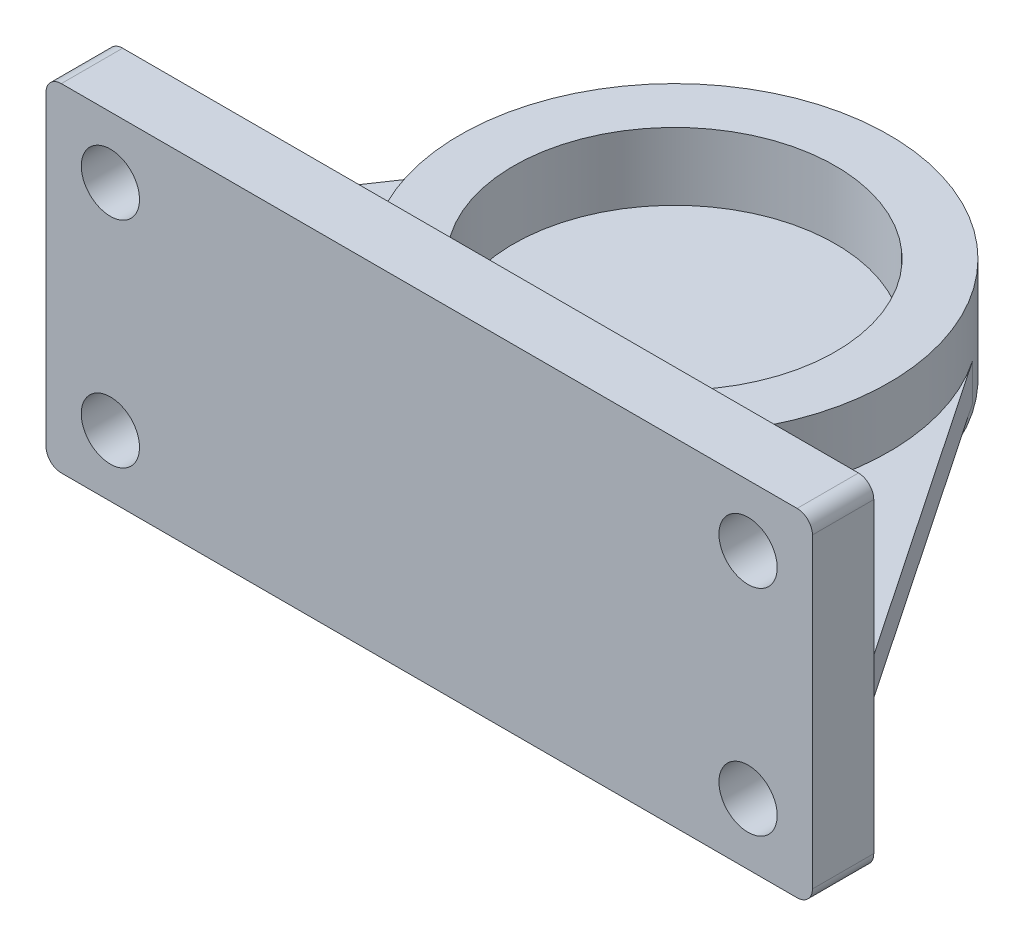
ISO-10303-21;
HEADER;
FILE_DESCRIPTION(('STEP AP214'),'2;1');
FILE_NAME('part.step','',(''),(''),'','','');
FILE_SCHEMA(('AUTOMOTIVE_DESIGN { 1 0 10303 214 1 1 1 1 }'));
ENDSEC;
DATA;
#1=APPLICATION_CONTEXT('core data for automotive mechanical design processes');
#2=APPLICATION_PROTOCOL_DEFINITION('international standard','automotive_design',2000,#1);
#3=PRODUCT_CONTEXT('',#1,'mechanical');
#4=PRODUCT('Part','Part','',(#3));
#5=PRODUCT_RELATED_PRODUCT_CATEGORY('part','',(#4));
#6=PRODUCT_DEFINITION_FORMATION('','',#4);
#7=PRODUCT_DEFINITION_CONTEXT('part definition',#1,'design');
#8=PRODUCT_DEFINITION('design','',#6,#7);
#9=PRODUCT_DEFINITION_SHAPE('','',#8);
#10=(LENGTH_UNIT() NAMED_UNIT(*) SI_UNIT(.MILLI.,.METRE.));
#11=(NAMED_UNIT(*) PLANE_ANGLE_UNIT() SI_UNIT($,.RADIAN.));
#12=(NAMED_UNIT(*) SI_UNIT($,.STERADIAN.) SOLID_ANGLE_UNIT());
#13=UNCERTAINTY_MEASURE_WITH_UNIT(LENGTH_MEASURE(1.E-05),#10,'distance_accuracy_value','');
#14=(GEOMETRIC_REPRESENTATION_CONTEXT(3) GLOBAL_UNCERTAINTY_ASSIGNED_CONTEXT((#13)) GLOBAL_UNIT_ASSIGNED_CONTEXT((#10,
#11,#12)) REPRESENTATION_CONTEXT('',''));
#15=CARTESIAN_POINT('',(0.,0.,0.));
#16=DIRECTION('',(0.,0.,1.));
#17=DIRECTION('',(1.,0.,0.));
#18=AXIS2_PLACEMENT_3D('',#15,#16,#17);
#19=CARTESIAN_POINT('',(-125.,-55.,0.));
#20=DIRECTION('',(0.,0.,1.));
#21=DIRECTION('',(1.,0.,0.));
#22=AXIS2_PLACEMENT_3D('',#19,#20,#21);
#23=PLANE('',#22);
#24=CARTESIAN_POINT('',(-104.,35.,0.));
#25=DIRECTION('',(0.,0.,-1.));
#26=DIRECTION('',(-1.,0.,0.));
#27=AXIS2_PLACEMENT_3D('',#24,#25,#26);
#28=CIRCLE('',#27,9.5);
#29=CARTESIAN_POINT('',(-113.5,35.,0.));
#30=VERTEX_POINT('',#29);
#31=EDGE_CURVE('E1142',#30,#30,#28,.T.);
#32=ORIENTED_EDGE('',*,*,#31,.F.);
#33=EDGE_LOOP('',(#32));
#34=FACE_BOUND('',#33,.T.);
#35=CARTESIAN_POINT('',(104.,35.,0.));
#36=DIRECTION('',(0.,0.,-1.));
#37=DIRECTION('',(-1.,0.,0.));
#38=AXIS2_PLACEMENT_3D('',#35,#36,#37);
#39=CIRCLE('',#38,9.5);
#40=CARTESIAN_POINT('',(94.5,35.,0.));
#41=VERTEX_POINT('',#40);
#42=EDGE_CURVE('E1148',#41,#41,#39,.T.);
#43=ORIENTED_EDGE('',*,*,#42,.F.);
#44=EDGE_LOOP('',(#43));
#45=FACE_BOUND('',#44,.T.);
#46=DIRECTION('',(0.,-1.,0.));
#47=VECTOR('',#46,1.);
#48=CARTESIAN_POINT('',(-125.,55.,0.));
#49=LINE('',#48,#47);
#50=CARTESIAN_POINT('',(-125.,50.,0.));
#51=VERTEX_POINT('',#50);
#52=CARTESIAN_POINT('',(-125.,6.,0.));
#53=VERTEX_POINT('',#52);
#54=EDGE_CURVE('E760',#51,#53,#49,.T.);
#55=ORIENTED_EDGE('',*,*,#54,.F.);
#56=CARTESIAN_POINT('',(-120.,50.,0.));
#57=DIRECTION('',(0.,0.,1.));
#58=DIRECTION('',(1.,0.,0.));
#59=AXIS2_PLACEMENT_3D('',#56,#57,#58);
#60=CIRCLE('',#59,5.);
#61=CARTESIAN_POINT('',(-120.,55.,0.));
#62=VERTEX_POINT('',#61);
#63=EDGE_CURVE('E842',#51,#62,#60,.F.);
#64=ORIENTED_EDGE('',*,*,#63,.T.);
#65=DIRECTION('',(-1.,0.,0.));
#66=VECTOR('',#65,1.);
#67=CARTESIAN_POINT('',(-125.,55.,0.));
#68=LINE('',#67,#66);
#69=CARTESIAN_POINT('',(120.,55.,0.));
#70=VERTEX_POINT('',#69);
#71=EDGE_CURVE('E285',#70,#62,#68,.T.);
#72=ORIENTED_EDGE('',*,*,#71,.F.);
#73=CARTESIAN_POINT('',(120.,50.,0.));
#74=DIRECTION('',(0.,0.,1.));
#75=DIRECTION('',(1.,0.,0.));
#76=AXIS2_PLACEMENT_3D('',#73,#74,#75);
#77=CIRCLE('',#76,5.);
#78=CARTESIAN_POINT('',(125.,50.,0.));
#79=VERTEX_POINT('',#78);
#80=EDGE_CURVE('E844',#70,#79,#77,.F.);
#81=ORIENTED_EDGE('',*,*,#80,.T.);
#82=DIRECTION('',(0.,1.,0.));
#83=VECTOR('',#82,1.);
#84=CARTESIAN_POINT('',(125.,55.,0.));
#85=LINE('',#84,#83);
#86=CARTESIAN_POINT('',(125.,6.,0.));
#87=VERTEX_POINT('',#86);
#88=EDGE_CURVE('E286',#87,#79,#85,.T.);
#89=ORIENTED_EDGE('',*,*,#88,.F.);
#90=DIRECTION('',(-1.,0.,0.));
#91=VECTOR('',#90,1.);
#92=CARTESIAN_POINT('',(125.,6.,0.));
#93=LINE('',#92,#91);
#94=CARTESIAN_POINT('',(80.6225774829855,6.,0.));
#95=VERTEX_POINT('',#94);
#96=EDGE_CURVE('E306',#87,#95,#93,.T.);
#97=ORIENTED_EDGE('',*,*,#96,.T.);
#98=DIRECTION('',(0.,-1.,0.));
#99=VECTOR('',#98,1.);
#100=CARTESIAN_POINT('',(80.6225774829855,25.5,0.));
#101=LINE('',#100,#99);
#102=CARTESIAN_POINT('',(80.6225774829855,25.5,0.));
#103=VERTEX_POINT('',#102);
#104=EDGE_CURVE('E752',#103,#95,#101,.T.);
#105=ORIENTED_EDGE('',*,*,#104,.F.);
#106=DIRECTION('',(1.,0.,0.));
#107=VECTOR('',#106,1.);
#108=CARTESIAN_POINT('',(-80.6225774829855,25.5,0.));
#109=LINE('',#108,#107);
#110=CARTESIAN_POINT('',(-80.6225774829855,25.5,0.));
#111=VERTEX_POINT('',#110);
#112=EDGE_CURVE('E749',#111,#103,#109,.T.);
#113=ORIENTED_EDGE('',*,*,#112,.F.);
#114=DIRECTION('',(0.,-1.,0.));
#115=VECTOR('',#114,1.);
#116=CARTESIAN_POINT('',(-80.6225774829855,25.5,0.));
#117=LINE('',#116,#115);
#118=CARTESIAN_POINT('',(-80.6225774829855,6.,0.));
#119=VERTEX_POINT('',#118);
#120=EDGE_CURVE('E756',#111,#119,#117,.T.);
#121=ORIENTED_EDGE('',*,*,#120,.T.);
#122=DIRECTION('',(1.,0.,0.));
#123=VECTOR('',#122,1.);
#124=CARTESIAN_POINT('',(-125.,6.,0.));
#125=LINE('',#124,#123);
#126=EDGE_CURVE('E334',#53,#119,#125,.T.);
#127=ORIENTED_EDGE('',*,*,#126,.F.);
#128=EDGE_LOOP('',(#55,#64,#72,#81,#89,#97,#105,#113,#121,#127));
#129=FACE_BOUND('',#128,.T.);
#130=ADVANCED_FACE('F67',(#34,#45,#129),#23,.F.);
#131=CARTESIAN_POINT('',(0.,25.5,-60.));
#132=DIRECTION('',(0.,-1.,0.));
#133=DIRECTION('',(0.,0.,-1.));
#134=AXIS2_PLACEMENT_3D('',#131,#132,#133);
#135=CYLINDRICAL_SURFACE('',#134,70.);
#136=CARTESIAN_POINT('',(0.,6.,-60.));
#137=DIRECTION('',(0.,-1.,0.));
#138=DIRECTION('',(0.,0.,-1.));
#139=AXIS2_PLACEMENT_3D('',#136,#137,#138);
#140=CIRCLE('',#139,70.);
#141=CARTESIAN_POINT('',(58.0070630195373,6.,-99.1813812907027));
#142=VERTEX_POINT('',#141);
#143=CARTESIAN_POINT('',(62.7064491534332,6.,-28.8888888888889));
#144=VERTEX_POINT('',#143);
#145=EDGE_CURVE('E324',#142,#144,#140,.T.);
#146=ORIENTED_EDGE('',*,*,#145,.F.);
#147=DIRECTION('',(0.,-1.,0.));
#148=VECTOR('',#147,1.);
#149=CARTESIAN_POINT('',(58.0070630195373,6.,-99.1813812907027));
#150=LINE('',#149,#148);
#151=CARTESIAN_POINT('',(58.0070630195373,-6.,-99.1813812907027));
#152=VERTEX_POINT('',#151);
#153=EDGE_CURVE('E299',#142,#152,#150,.T.);
#154=ORIENTED_EDGE('',*,*,#153,.T.);
#155=CARTESIAN_POINT('',(0.,-6.,-60.));
#156=DIRECTION('',(0.,-1.,0.));
#157=DIRECTION('',(0.,0.,-1.));
#158=AXIS2_PLACEMENT_3D('',#155,#156,#157);
#159=CIRCLE('',#158,70.);
#160=CARTESIAN_POINT('',(62.7064491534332,-6.,-28.8888888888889));
#161=VERTEX_POINT('',#160);
#162=EDGE_CURVE('E298',#152,#161,#159,.T.);
#163=ORIENTED_EDGE('',*,*,#162,.T.);
#164=DIRECTION('',(0.,-1.,0.));
#165=VECTOR('',#164,1.);
#166=CARTESIAN_POINT('',(62.7064491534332,25.5,-28.8888888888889));
#167=LINE('',#166,#165);
#168=CARTESIAN_POINT('',(62.7064491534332,-8.5,-28.8888888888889));
#169=VERTEX_POINT('',#168);
#170=EDGE_CURVE('E734',#161,#169,#167,.T.);
#171=ORIENTED_EDGE('',*,*,#170,.T.);
#172=CARTESIAN_POINT('',(0.,-8.5,-60.));
#173=DIRECTION('',(0.,1.,0.));
#174=DIRECTION('',(0.895806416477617,0.,0.444444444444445));
#175=AXIS2_PLACEMENT_3D('',#172,#173,#174);
#176=CIRCLE('',#175,70.);
#177=CARTESIAN_POINT('',(46.99982169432,-8.5,-111.875046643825));
#178=VERTEX_POINT('',#177);
#179=EDGE_CURVE('E722',#169,#178,#176,.T.);
#180=ORIENTED_EDGE('',*,*,#179,.T.);
#181=CARTESIAN_POINT('',(34.9999839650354,-8.5,-120.621787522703));
#182=CARTESIAN_POINT('',(35.5383742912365,-8.49999829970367,-120.310948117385));
#183=CARTESIAN_POINT('',(36.0725993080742,-8.49998990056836,-119.992949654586));
#184=CARTESIAN_POINT('',(37.1323655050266,-8.49997422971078,-119.342850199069));
#185=CARTESIAN_POINT('',(37.657907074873,-8.49996695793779,-119.010749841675));
#186=CARTESIAN_POINT('',(39.2209799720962,-8.49996861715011,-117.993621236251));
#187=CARTESIAN_POINT('',(40.2450308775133,-8.50000101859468,-117.287724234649));
#188=CARTESIAN_POINT('',(42.2482113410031,-8.49999897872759,-115.826664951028));
#189=CARTESIAN_POINT('',(43.2275682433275,-8.49996492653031,-115.071814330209));
#190=CARTESIAN_POINT('',(44.6656860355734,-8.49996287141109,-113.901380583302));
#191=CARTESIAN_POINT('',(45.1400053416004,-8.49997036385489,-113.504786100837));
#192=CARTESIAN_POINT('',(46.0779778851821,-8.49998730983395,-112.699166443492));
#193=CARTESIAN_POINT('',(46.5416309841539,-8.49999676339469,-112.290141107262));
#194=CARTESIAN_POINT('',(46.9998039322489,-8.5,-111.875027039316));
#195=B_SPLINE_CURVE_WITH_KNOTS('',3,(#181,#182,#183,#184,#185,#186,#187,#188,#189,#190,#191,
#192,#193,#194),.UNSPECIFIED.,.F.,.F.,(4,2,2,2,2,2,4),(0.,1.8649276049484,3.72977127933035,
7.45921164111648,11.1668800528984,13.0215198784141,14.8761837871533),.UNSPECIFIED.);
#196=CARTESIAN_POINT('',(34.9999919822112,-8.5,-120.621801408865));
#197=VERTEX_POINT('',#196);
#198=EDGE_CURVE('E869',#197,#178,#195,.T.);
#199=ORIENTED_EDGE('',*,*,#198,.F.);
#200=CARTESIAN_POINT('',(0.,-8.5,-60.));
#201=DIRECTION('',(0.,1.,0.));
#202=DIRECTION('',(0.49999977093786,0.,-0.866025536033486));
#203=AXIS2_PLACEMENT_3D('',#200,#201,#202);
#204=CIRCLE('',#203,70.);
#205=CARTESIAN_POINT('',(-34.9999999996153,-8.5,-120.62179077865));
#206=VERTEX_POINT('',#205);
#207=EDGE_CURVE('E670',#197,#206,#204,.T.);
#208=ORIENTED_EDGE('',*,*,#207,.T.);
#209=CARTESIAN_POINT('',(0.,-8.5,-60.));
#210=DIRECTION('',(0.,1.,0.));
#211=DIRECTION('',(0.,0.,-1.));
#212=AXIS2_PLACEMENT_3D('',#209,#210,#211);
#213=CIRCLE('',#212,70.);
#214=CARTESIAN_POINT('',(-47.0000000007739,-8.5,-111.874893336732));
#215=VERTEX_POINT('',#214);
#216=EDGE_CURVE('E346',#206,#215,#213,.T.);
#217=ORIENTED_EDGE('',*,*,#216,.T.);
#218=CARTESIAN_POINT('',(0.,-8.5,-60.));
#219=DIRECTION('',(0.,1.,0.));
#220=DIRECTION('',(-0.671428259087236,0.,-0.741069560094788));
#221=AXIS2_PLACEMENT_3D('',#218,#219,#220);
#222=CIRCLE('',#221,70.);
#223=CARTESIAN_POINT('',(-62.7064491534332,-8.5,-28.8888888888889));
#224=VERTEX_POINT('',#223);
#225=EDGE_CURVE('E716',#215,#224,#222,.T.);
#226=ORIENTED_EDGE('',*,*,#225,.T.);
#227=DIRECTION('',(0.,-1.,0.));
#228=VECTOR('',#227,1.);
#229=CARTESIAN_POINT('',(-62.7064491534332,25.5,-28.8888888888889));
#230=LINE('',#229,#228);
#231=CARTESIAN_POINT('',(-62.7064491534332,-6.,-28.8888888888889));
#232=VERTEX_POINT('',#231);
#233=EDGE_CURVE('E625',#232,#224,#230,.T.);
#234=ORIENTED_EDGE('',*,*,#233,.F.);
#235=CARTESIAN_POINT('',(0.,-6.,-60.));
#236=DIRECTION('',(0.,-1.,0.));
#237=DIRECTION('',(0.,0.,-1.));
#238=AXIS2_PLACEMENT_3D('',#235,#236,#237);
#239=CIRCLE('',#238,70.);
#240=CARTESIAN_POINT('',(-58.0070630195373,-6.,-99.1813812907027));
#241=VERTEX_POINT('',#240);
#242=EDGE_CURVE('E901',#232,#241,#239,.T.);
#243=ORIENTED_EDGE('',*,*,#242,.T.);
#244=DIRECTION('',(0.,-1.,0.));
#245=VECTOR('',#244,1.);
#246=CARTESIAN_POINT('',(-58.0070630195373,6.,-99.1813812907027));
#247=LINE('',#246,#245);
#248=CARTESIAN_POINT('',(-58.0070630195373,6.,-99.1813812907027));
#249=VERTEX_POINT('',#248);
#250=EDGE_CURVE('E339',#249,#241,#247,.T.);
#251=ORIENTED_EDGE('',*,*,#250,.F.);
#252=CARTESIAN_POINT('',(0.,6.,-60.));
#253=DIRECTION('',(0.,-1.,0.));
#254=DIRECTION('',(0.,0.,-1.));
#255=AXIS2_PLACEMENT_3D('',#252,#253,#254);
#256=CIRCLE('',#255,70.);
#257=CARTESIAN_POINT('',(-62.7064491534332,6.,-28.8888888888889));
#258=VERTEX_POINT('',#257);
#259=EDGE_CURVE('E794',#258,#249,#256,.T.);
#260=ORIENTED_EDGE('',*,*,#259,.F.);
#261=CARTESIAN_POINT('',(-62.7064491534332,25.5,-28.8888888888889));
#262=VERTEX_POINT('',#261);
#263=EDGE_CURVE('E732',#262,#258,#230,.T.);
#264=ORIENTED_EDGE('',*,*,#263,.F.);
#265=CARTESIAN_POINT('',(0.,25.5,-60.));
#266=DIRECTION('',(0.,1.,0.));
#267=DIRECTION('',(0.,0.,1.));
#268=AXIS2_PLACEMENT_3D('',#265,#266,#267);
#269=CIRCLE('',#268,70.);
#270=CARTESIAN_POINT('',(62.7064491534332,25.5,-28.8888888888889));
#271=VERTEX_POINT('',#270);
#272=EDGE_CURVE('E743',#271,#262,#269,.T.);
#273=ORIENTED_EDGE('',*,*,#272,.F.);
#274=EDGE_CURVE('E679',#271,#144,#167,.T.);
#275=ORIENTED_EDGE('',*,*,#274,.T.);
#276=EDGE_LOOP('',(#146,#154,#163,#171,#180,#199,#208,#217,#226,#234,#243,#251,#260,#264,#273,#275));
#277=FACE_BOUND('',#276,.T.);
#278=ADVANCED_FACE('F541',(#277),#135,.T.);
#279=CARTESIAN_POINT('',(80.6225774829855,25.5,-20.));
#280=DIRECTION('',(0.,-1.,0.));
#281=DIRECTION('',(0.,0.,-1.));
#282=AXIS2_PLACEMENT_3D('',#279,#280,#281);
#283=CYLINDRICAL_SURFACE('',#282,20.);
#284=CARTESIAN_POINT('',(80.6225774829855,6.,-20.));
#285=DIRECTION('',(0.,-1.,0.));
#286=DIRECTION('',(0.,0.,-1.));
#287=AXIS2_PLACEMENT_3D('',#284,#285,#286);
#288=CIRCLE('',#287,20.);
#289=EDGE_CURVE('E788',#144,#95,#288,.F.);
#290=ORIENTED_EDGE('',*,*,#289,.F.);
#291=ORIENTED_EDGE('',*,*,#274,.F.);
#292=CARTESIAN_POINT('',(80.6225774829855,25.5,-20.));
#293=DIRECTION('',(0.,-1.,0.));
#294=DIRECTION('',(0.,0.,1.));
#295=AXIS2_PLACEMENT_3D('',#292,#293,#294);
#296=CIRCLE('',#295,20.);
#297=EDGE_CURVE('E745',#103,#271,#296,.T.);
#298=ORIENTED_EDGE('',*,*,#297,.F.);
#299=ORIENTED_EDGE('',*,*,#104,.T.);
#300=EDGE_LOOP('',(#290,#291,#298,#299));
#301=FACE_BOUND('',#300,.T.);
#302=ADVANCED_FACE('F550',(#301),#283,.F.);
#303=CARTESIAN_POINT('',(104.,-35.,0.));
#304=DIRECTION('',(0.,0.,-1.));
#305=DIRECTION('',(-1.,0.,0.));
#306=AXIS2_PLACEMENT_3D('',#303,#304,#305);
#307=CIRCLE('',#306,9.5);
#308=CARTESIAN_POINT('',(94.5,-35.,0.));
#309=VERTEX_POINT('',#308);
#310=EDGE_CURVE('E1132',#309,#309,#307,.T.);
#311=ORIENTED_EDGE('',*,*,#310,.F.);
#312=EDGE_LOOP('',(#311));
#313=FACE_BOUND('',#312,.T.);
#314=CARTESIAN_POINT('',(125.,-50.,0.));
#315=VERTEX_POINT('',#314);
#316=CARTESIAN_POINT('',(125.,-6.,0.));
#317=VERTEX_POINT('',#316);
#318=EDGE_CURVE('E276',#315,#317,#85,.T.);
#319=ORIENTED_EDGE('',*,*,#318,.F.);
#320=CARTESIAN_POINT('',(120.,-50.,0.));
#321=DIRECTION('',(0.,0.,1.));
#322=DIRECTION('',(1.,0.,0.));
#323=AXIS2_PLACEMENT_3D('',#320,#321,#322);
#324=CIRCLE('',#323,5.);
#325=CARTESIAN_POINT('',(120.,-55.,0.));
#326=VERTEX_POINT('',#325);
#327=EDGE_CURVE('E12',#315,#326,#324,.F.);
#328=ORIENTED_EDGE('',*,*,#327,.T.);
#329=DIRECTION('',(1.,0.,0.));
#330=VECTOR('',#329,1.);
#331=CARTESIAN_POINT('',(-125.,-55.,0.));
#332=LINE('',#331,#330);
#333=CARTESIAN_POINT('',(57.,-55.,0.));
#334=VERTEX_POINT('',#333);
#335=EDGE_CURVE('E594',#334,#326,#332,.T.);
#336=ORIENTED_EDGE('',*,*,#335,.F.);
#337=DIRECTION('',(0.,1.,0.));
#338=VECTOR('',#337,1.);
#339=CARTESIAN_POINT('',(57.,-55.,0.));
#340=LINE('',#339,#338);
#341=CARTESIAN_POINT('',(57.,-8.5,0.));
#342=VERTEX_POINT('',#341);
#343=EDGE_CURVE('E773',#334,#342,#340,.T.);
#344=ORIENTED_EDGE('',*,*,#343,.T.);
#345=DIRECTION('',(1.,0.,0.));
#346=VECTOR('',#345,1.);
#347=CARTESIAN_POINT('',(-80.6225774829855,-8.5,0.));
#348=LINE('',#347,#346);
#349=CARTESIAN_POINT('',(80.6225774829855,-8.5,0.));
#350=VERTEX_POINT('',#349);
#351=EDGE_CURVE('E638',#342,#350,#348,.T.);
#352=ORIENTED_EDGE('',*,*,#351,.T.);
#353=CARTESIAN_POINT('',(80.6225774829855,-6.,0.));
#354=VERTEX_POINT('',#353);
#355=EDGE_CURVE('E311',#354,#350,#101,.T.);
#356=ORIENTED_EDGE('',*,*,#355,.F.);
#357=DIRECTION('',(-1.,0.,0.));
#358=VECTOR('',#357,1.);
#359=CARTESIAN_POINT('',(125.,-6.,0.));
#360=LINE('',#359,#358);
#361=EDGE_CURVE('E303',#317,#354,#360,.T.);
#362=ORIENTED_EDGE('',*,*,#361,.F.);
#363=EDGE_LOOP('',(#319,#328,#336,#344,#352,#356,#362));
#364=FACE_BOUND('',#363,.T.);
#365=ADVANCED_FACE('F309',(#313,#364),#23,.F.);
#366=CARTESIAN_POINT('',(-80.6225774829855,25.5,-20.));
#367=DIRECTION('',(0.,-1.,0.));
#368=DIRECTION('',(0.,0.,-1.));
#369=AXIS2_PLACEMENT_3D('',#366,#367,#368);
#370=CYLINDRICAL_SURFACE('',#369,20.);
#371=CARTESIAN_POINT('',(-80.6225774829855,6.,-20.));
#372=DIRECTION('',(0.,-1.,0.));
#373=DIRECTION('',(0.,0.,-1.));
#374=AXIS2_PLACEMENT_3D('',#371,#372,#373);
#375=CIRCLE('',#374,20.);
#376=EDGE_CURVE('E344',#119,#258,#375,.F.);
#377=ORIENTED_EDGE('',*,*,#376,.F.);
#378=ORIENTED_EDGE('',*,*,#120,.F.);
#379=CARTESIAN_POINT('',(-80.6225774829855,25.5,-20.));
#380=DIRECTION('',(0.,-1.,0.));
#381=DIRECTION('',(0.,0.,-1.));
#382=AXIS2_PLACEMENT_3D('',#379,#380,#381);
#383=CIRCLE('',#382,20.);
#384=EDGE_CURVE('E652',#262,#111,#383,.T.);
#385=ORIENTED_EDGE('',*,*,#384,.F.);
#386=ORIENTED_EDGE('',*,*,#263,.T.);
#387=EDGE_LOOP('',(#377,#378,#385,#386));
#388=FACE_BOUND('',#387,.T.);
#389=ADVANCED_FACE('F556',(#388),#370,.F.);
#390=CARTESIAN_POINT('',(-80.6225774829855,-8.5,-20.));
#391=DIRECTION('',(0.,-1.,0.));
#392=DIRECTION('',(0.,0.,-1.));
#393=AXIS2_PLACEMENT_3D('',#390,#391,#392);
#394=PLANE('',#393);
#395=CARTESIAN_POINT('',(-25.,-8.5,0.));
#396=VERTEX_POINT('',#395);
#397=CARTESIAN_POINT('',(25.,-8.5,0.));
#398=VERTEX_POINT('',#397);
#399=EDGE_CURVE('E664',#396,#398,#348,.T.);
#400=ORIENTED_EDGE('',*,*,#399,.F.);
#401=CARTESIAN_POINT('',(-25.,-8.5,-10.));
#402=DIRECTION('',(0.,-1.,0.));
#403=DIRECTION('',(0.,0.,-1.));
#404=AXIS2_PLACEMENT_3D('',#401,#402,#403);
#405=CIRCLE('',#404,10.);
#406=CARTESIAN_POINT('',(-35.,-8.5,-9.99999999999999));
#407=VERTEX_POINT('',#406);
#408=EDGE_CURVE('E602',#396,#407,#405,.T.);
#409=ORIENTED_EDGE('',*,*,#408,.T.);
#410=DIRECTION('',(0.,0.,-1.));
#411=VECTOR('',#410,1.);
#412=CARTESIAN_POINT('',(-35.,-8.5,-120.621778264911));
#413=LINE('',#412,#411);
#414=EDGE_CURVE('E610',#407,#206,#413,.T.);
#415=ORIENTED_EDGE('',*,*,#414,.T.);
#416=ORIENTED_EDGE('',*,*,#207,.F.);
#417=DIRECTION('',(0.,0.,-1.));
#418=VECTOR('',#417,1.);
#419=CARTESIAN_POINT('',(35.,-8.5,-120.621778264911));
#420=LINE('',#419,#418);
#421=CARTESIAN_POINT('',(35.,-8.5,-9.99999999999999));
#422=VERTEX_POINT('',#421);
#423=EDGE_CURVE('E615',#422,#197,#420,.T.);
#424=ORIENTED_EDGE('',*,*,#423,.F.);
#425=CARTESIAN_POINT('',(25.,-8.5,-10.));
#426=DIRECTION('',(0.,-1.,0.));
#427=DIRECTION('',(0.,0.,-1.));
#428=AXIS2_PLACEMENT_3D('',#425,#426,#427);
#429=CIRCLE('',#428,10.);
#430=EDGE_CURVE('E603',#422,#398,#429,.T.);
#431=ORIENTED_EDGE('',*,*,#430,.T.);
#432=EDGE_LOOP('',(#400,#409,#415,#416,#424,#431));
#433=FACE_BOUND('',#432,.T.);
#434=ADVANCED_FACE('F570',(#433),#394,.T.);
#435=CARTESIAN_POINT('',(-25.,-55.,0.));
#436=VERTEX_POINT('',#435);
#437=CARTESIAN_POINT('',(25.0000037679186,-55.,7.26643628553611E-13));
#438=VERTEX_POINT('',#437);
#439=EDGE_CURVE('E584',#436,#438,#332,.T.);
#440=ORIENTED_EDGE('',*,*,#439,.F.);
#441=DIRECTION('',(0.,1.,0.));
#442=VECTOR('',#441,1.);
#443=CARTESIAN_POINT('',(-25.,-55.,0.));
#444=LINE('',#443,#442);
#445=EDGE_CURVE('E588',#436,#396,#444,.T.);
#446=ORIENTED_EDGE('',*,*,#445,.T.);
#447=ORIENTED_EDGE('',*,*,#399,.T.);
#448=DIRECTION('',(0.,-1.,0.));
#449=VECTOR('',#448,1.);
#450=CARTESIAN_POINT('',(25.,-55.,0.));
#451=LINE('',#450,#449);
#452=EDGE_CURVE('E591',#398,#438,#451,.T.);
#453=ORIENTED_EDGE('',*,*,#452,.T.);
#454=EDGE_LOOP('',(#440,#446,#447,#453));
#455=FACE_BOUND('',#454,.T.);
#456=ADVANCED_FACE('F558',(#455),#23,.F.);
#457=DIRECTION('',(0.,0.,1.));
#458=VECTOR('',#457,1.);
#459=CARTESIAN_POINT('',(-47.,-8.5,-111.874849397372));
#460=LINE('',#459,#458);
#461=CARTESIAN_POINT('',(-47.,-8.5,-9.99999999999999));
#462=VERTEX_POINT('',#461);
#463=EDGE_CURVE('E614',#215,#462,#460,.T.);
#464=ORIENTED_EDGE('',*,*,#463,.T.);
#465=CARTESIAN_POINT('',(-57.,-8.5,-10.));
#466=DIRECTION('',(0.,-1.,0.));
#467=DIRECTION('',(0.,0.,-1.));
#468=AXIS2_PLACEMENT_3D('',#465,#466,#467);
#469=CIRCLE('',#468,10.);
#470=CARTESIAN_POINT('',(-57.,-8.5,0.));
#471=VERTEX_POINT('',#470);
#472=EDGE_CURVE('E606',#462,#471,#469,.T.);
#473=ORIENTED_EDGE('',*,*,#472,.T.);
#474=CARTESIAN_POINT('',(-80.6225774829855,-8.5,0.));
#475=VERTEX_POINT('',#474);
#476=EDGE_CURVE('E660',#475,#471,#348,.T.);
#477=ORIENTED_EDGE('',*,*,#476,.F.);
#478=CARTESIAN_POINT('',(-80.6225774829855,-8.5,-20.));
#479=DIRECTION('',(0.,-1.,0.));
#480=DIRECTION('',(0.,0.,-1.));
#481=AXIS2_PLACEMENT_3D('',#478,#479,#480);
#482=CIRCLE('',#481,20.);
#483=EDGE_CURVE('E635',#224,#475,#482,.T.);
#484=ORIENTED_EDGE('',*,*,#483,.F.);
#485=ORIENTED_EDGE('',*,*,#225,.F.);
#486=EDGE_LOOP('',(#464,#473,#477,#484,#485));
#487=FACE_BOUND('',#486,.T.);
#488=ADVANCED_FACE('F567',(#487),#394,.T.);
#489=ORIENTED_EDGE('',*,*,#351,.F.);
#490=CARTESIAN_POINT('',(57.,-8.5,-10.));
#491=DIRECTION('',(0.,-1.,0.));
#492=DIRECTION('',(0.,0.,-1.));
#493=AXIS2_PLACEMENT_3D('',#490,#491,#492);
#494=CIRCLE('',#493,10.);
#495=CARTESIAN_POINT('',(47.,-8.5,-9.99999999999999));
#496=VERTEX_POINT('',#495);
#497=EDGE_CURVE('E861',#342,#496,#494,.T.);
#498=ORIENTED_EDGE('',*,*,#497,.T.);
#499=DIRECTION('',(0.,0.,1.));
#500=VECTOR('',#499,1.);
#501=CARTESIAN_POINT('',(47.,-8.5,-111.874849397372));
#502=LINE('',#501,#500);
#503=EDGE_CURVE('E644',#178,#496,#502,.T.);
#504=ORIENTED_EDGE('',*,*,#503,.F.);
#505=ORIENTED_EDGE('',*,*,#179,.F.);
#506=CARTESIAN_POINT('',(80.6225774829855,-8.5,-20.));
#507=DIRECTION('',(0.,-1.,0.));
#508=DIRECTION('',(0.,0.,1.));
#509=AXIS2_PLACEMENT_3D('',#506,#507,#508);
#510=CIRCLE('',#509,20.);
#511=EDGE_CURVE('E663',#350,#169,#510,.T.);
#512=ORIENTED_EDGE('',*,*,#511,.F.);
#513=EDGE_LOOP('',(#489,#498,#504,#505,#512));
#514=FACE_BOUND('',#513,.T.);
#515=ADVANCED_FACE('F560',(#514),#394,.T.);
#516=CARTESIAN_POINT('',(-104.,-35.,0.));
#517=DIRECTION('',(0.,0.,-1.));
#518=DIRECTION('',(-1.,0.,0.));
#519=AXIS2_PLACEMENT_3D('',#516,#517,#518);
#520=CIRCLE('',#519,9.5);
#521=CARTESIAN_POINT('',(-113.5,-35.,0.));
#522=VERTEX_POINT('',#521);
#523=EDGE_CURVE('E1134',#522,#522,#520,.T.);
#524=ORIENTED_EDGE('',*,*,#523,.F.);
#525=EDGE_LOOP('',(#524));
#526=FACE_BOUND('',#525,.T.);
#527=CARTESIAN_POINT('',(-120.,-55.,0.));
#528=VERTEX_POINT('',#527);
#529=CARTESIAN_POINT('',(-56.999996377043,-55.,7.19459603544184E-13));
#530=VERTEX_POINT('',#529);
#531=EDGE_CURVE('E593',#528,#530,#332,.T.);
#532=ORIENTED_EDGE('',*,*,#531,.F.);
#533=CARTESIAN_POINT('',(-120.,-50.,0.));
#534=DIRECTION('',(0.,0.,1.));
#535=DIRECTION('',(1.,0.,0.));
#536=AXIS2_PLACEMENT_3D('',#533,#534,#535);
#537=CIRCLE('',#536,5.);
#538=CARTESIAN_POINT('',(-125.,-50.,0.));
#539=VERTEX_POINT('',#538);
#540=EDGE_CURVE('E88',#528,#539,#537,.F.);
#541=ORIENTED_EDGE('',*,*,#540,.T.);
#542=CARTESIAN_POINT('',(-125.,-6.,0.));
#543=VERTEX_POINT('',#542);
#544=EDGE_CURVE('E759',#543,#539,#49,.T.);
#545=ORIENTED_EDGE('',*,*,#544,.F.);
#546=DIRECTION('',(1.,0.,0.));
#547=VECTOR('',#546,1.);
#548=CARTESIAN_POINT('',(-125.,-6.,0.));
#549=LINE('',#548,#547);
#550=CARTESIAN_POINT('',(-80.6225774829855,-6.,0.));
#551=VERTEX_POINT('',#550);
#552=EDGE_CURVE('E328',#543,#551,#549,.T.);
#553=ORIENTED_EDGE('',*,*,#552,.T.);
#554=EDGE_CURVE('E755',#551,#475,#117,.T.);
#555=ORIENTED_EDGE('',*,*,#554,.T.);
#556=ORIENTED_EDGE('',*,*,#476,.T.);
#557=DIRECTION('',(0.,-1.,0.));
#558=VECTOR('',#557,1.);
#559=CARTESIAN_POINT('',(-57.,-55.,0.));
#560=LINE('',#559,#558);
#561=EDGE_CURVE('E789',#471,#530,#560,.T.);
#562=ORIENTED_EDGE('',*,*,#561,.T.);
#563=EDGE_LOOP('',(#532,#541,#545,#553,#555,#556,#562));
#564=FACE_BOUND('',#563,.T.);
#565=ADVANCED_FACE('F544',(#526,#564),#23,.F.);
#566=CARTESIAN_POINT('',(-125.,55.,20.));
#567=DIRECTION('',(1.,0.,0.));
#568=DIRECTION('',(0.,1.,0.));
#569=AXIS2_PLACEMENT_3D('',#566,#567,#568);
#570=PLANE('',#569);
#571=DIRECTION('',(0.,-1.,0.));
#572=VECTOR('',#571,1.);
#573=CARTESIAN_POINT('',(-125.,55.,20.));
#574=LINE('',#573,#572);
#575=CARTESIAN_POINT('',(-125.,50.,20.));
#576=VERTEX_POINT('',#575);
#577=CARTESIAN_POINT('',(-125.,-50.,20.));
#578=VERTEX_POINT('',#577);
#579=EDGE_CURVE('E890',#576,#578,#574,.T.);
#580=ORIENTED_EDGE('',*,*,#579,.F.);
#581=DIRECTION('',(0.,0.,-1.));
#582=VECTOR('',#581,1.);
#583=CARTESIAN_POINT('',(-125.,50.,20.));
#584=LINE('',#583,#582);
#585=EDGE_CURVE('E846',#576,#51,#584,.T.);
#586=ORIENTED_EDGE('',*,*,#585,.T.);
#587=ORIENTED_EDGE('',*,*,#54,.T.);
#588=DIRECTION('',(0.,-1.,0.));
#589=VECTOR('',#588,1.);
#590=CARTESIAN_POINT('',(-125.,6.,0.));
#591=LINE('',#590,#589);
#592=EDGE_CURVE('E336',#53,#543,#591,.T.);
#593=ORIENTED_EDGE('',*,*,#592,.T.);
#594=ORIENTED_EDGE('',*,*,#544,.T.);
#595=DIRECTION('',(0.,0.,-1.));
#596=VECTOR('',#595,1.);
#597=CARTESIAN_POINT('',(-125.,-50.,20.));
#598=LINE('',#597,#596);
#599=EDGE_CURVE('E849',#539,#578,#598,.F.);
#600=ORIENTED_EDGE('',*,*,#599,.T.);
#601=EDGE_LOOP('',(#580,#586,#587,#593,#594,#600));
#602=FACE_BOUND('',#601,.T.);
#603=ADVANCED_FACE('F69',(#602),#570,.F.);
#604=CARTESIAN_POINT('',(-125.,-55.,20.));
#605=DIRECTION('',(0.,1.,0.));
#606=DIRECTION('',(-1.,0.,0.));
#607=AXIS2_PLACEMENT_3D('',#604,#605,#606);
#608=PLANE('',#607);
#609=DIRECTION('',(1.,0.,0.));
#610=VECTOR('',#609,1.);
#611=CARTESIAN_POINT('',(-125.,-55.,20.));
#612=LINE('',#611,#610);
#613=CARTESIAN_POINT('',(-120.,-55.,20.));
#614=VERTEX_POINT('',#613);
#615=CARTESIAN_POINT('',(120.,-55.,20.));
#616=VERTEX_POINT('',#615);
#617=EDGE_CURVE('E829',#614,#616,#612,.T.);
#618=ORIENTED_EDGE('',*,*,#617,.F.);
#619=DIRECTION('',(0.,0.,-1.));
#620=VECTOR('',#619,1.);
#621=CARTESIAN_POINT('',(-120.,-55.,20.));
#622=LINE('',#621,#620);
#623=EDGE_CURVE('E806',#614,#528,#622,.T.);
#624=ORIENTED_EDGE('',*,*,#623,.T.);
#625=ORIENTED_EDGE('',*,*,#531,.T.);
#626=CARTESIAN_POINT('',(-47.,-55.,0.));
#627=CARTESIAN_POINT('',(-48.2427056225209,-55.,0.));
#628=CARTESIAN_POINT('',(-49.4854112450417,-55.,0.));
#629=CARTESIAN_POINT('',(-52.8187433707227,-55.,0.));
#630=CARTESIAN_POINT('',(-54.9093698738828,-55.,0.));
#631=CARTESIAN_POINT('',(-56.999996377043,-55.,0.));
#632=B_SPLINE_CURVE_WITH_KNOTS('',3,(#626,#627,#628,#629,#630,#631),.UNSPECIFIED.,.F.,.F.,(4,2,
4),(0.,3.72811686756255,9.99999637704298),.UNSPECIFIED.);
#633=CARTESIAN_POINT('',(-47.,-55.,0.));
#634=VERTEX_POINT('',#633);
#635=EDGE_CURVE('E416',#634,#530,#632,.T.);
#636=ORIENTED_EDGE('',*,*,#635,.F.);
#637=DIRECTION('',(-1.,0.,0.));
#638=VECTOR('',#637,1.);
#639=CARTESIAN_POINT('',(-35.,-55.,0.));
#640=LINE('',#639,#638);
#641=CARTESIAN_POINT('',(-35.,-55.,0.));
#642=VERTEX_POINT('',#641);
#643=EDGE_CURVE('E352',#642,#634,#640,.T.);
#644=ORIENTED_EDGE('',*,*,#643,.F.);
#645=CARTESIAN_POINT('',(-35.,-55.,0.));
#646=CARTESIAN_POINT('',(-33.7572943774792,-55.,0.));
#647=CARTESIAN_POINT('',(-32.5145887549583,-55.,0.));
#648=CARTESIAN_POINT('',(-29.1812566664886,-55.,0.));
#649=CARTESIAN_POINT('',(-27.0906302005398,-55.,0.));
#650=CARTESIAN_POINT('',(-25.0000037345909,-55.,0.));
#651=B_SPLINE_CURVE_WITH_KNOTS('',3,(#645,#646,#647,#648,#649,#650),.UNSPECIFIED.,.F.,.F.,(4,2,
4),(0.,3.72811686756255,9.99999626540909),.UNSPECIFIED.);
#652=EDGE_CURVE('E418',#642,#436,#651,.T.);
#653=ORIENTED_EDGE('',*,*,#652,.T.);
#654=ORIENTED_EDGE('',*,*,#439,.T.);
#655=CARTESIAN_POINT('',(35.,-55.,0.));
#656=CARTESIAN_POINT('',(33.7448673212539,-55.,0.));
#657=CARTESIAN_POINT('',(32.4897346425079,-55.,0.));
#658=CARTESIAN_POINT('',(29.1564025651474,-55.,0.));
#659=CARTESIAN_POINT('',(27.078203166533,-55.,0.));
#660=CARTESIAN_POINT('',(25.0000037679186,-55.,0.));
#661=B_SPLINE_CURVE_WITH_KNOTS('',3,(#655,#656,#657,#658,#659,#660),.UNSPECIFIED.,.F.,.F.,(4,2,
4),(0.,3.76539803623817,9.99999623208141),.UNSPECIFIED.);
#662=CARTESIAN_POINT('',(35.,-55.,0.));
#663=VERTEX_POINT('',#662);
#664=EDGE_CURVE('E455',#663,#438,#661,.T.);
#665=ORIENTED_EDGE('',*,*,#664,.F.);
#666=DIRECTION('',(1.,0.,0.));
#667=VECTOR('',#666,1.);
#668=CARTESIAN_POINT('',(35.,-55.,0.));
#669=LINE('',#668,#667);
#670=CARTESIAN_POINT('',(47.,-55.,0.));
#671=VERTEX_POINT('',#670);
#672=EDGE_CURVE('E633',#663,#671,#669,.T.);
#673=ORIENTED_EDGE('',*,*,#672,.T.);
#674=CARTESIAN_POINT('',(47.,-55.,0.));
#675=CARTESIAN_POINT('',(48.2551326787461,-55.,0.));
#676=CARTESIAN_POINT('',(49.5102653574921,-55.,0.));
#677=CARTESIAN_POINT('',(52.8435974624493,-55.,0.));
#678=CARTESIAN_POINT('',(54.9217968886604,-55.,0.));
#679=CARTESIAN_POINT('',(56.9999963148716,-55.,0.));
#680=B_SPLINE_CURVE_WITH_KNOTS('',3,(#674,#675,#676,#677,#678,#679),.UNSPECIFIED.,.F.,.F.,(4,2,
4),(0.,3.76539803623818,9.99999631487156),.UNSPECIFIED.);
#681=EDGE_CURVE('E456',#671,#334,#680,.T.);
#682=ORIENTED_EDGE('',*,*,#681,.T.);
#683=ORIENTED_EDGE('',*,*,#335,.T.);
#684=DIRECTION('',(0.,0.,-1.));
#685=VECTOR('',#684,1.);
#686=CARTESIAN_POINT('',(120.,-55.,20.));
#687=LINE('',#686,#685);
#688=EDGE_CURVE('E811',#326,#616,#687,.F.);
#689=ORIENTED_EDGE('',*,*,#688,.T.);
#690=EDGE_LOOP('',(#618,#624,#625,#636,#644,#653,#654,#665,#673,#682,#683,#689));
#691=FACE_BOUND('',#690,.T.);
#692=ADVANCED_FACE('F419',(#691),#608,.F.);
#693=CARTESIAN_POINT('',(125.,55.,20.));
#694=DIRECTION('',(-1.,0.,0.));
#695=DIRECTION('',(0.,0.,1.));
#696=AXIS2_PLACEMENT_3D('',#693,#694,#695);
#697=PLANE('',#696);
#698=ORIENTED_EDGE('',*,*,#88,.T.);
#699=DIRECTION('',(0.,0.,-1.));
#700=VECTOR('',#699,1.);
#701=CARTESIAN_POINT('',(125.,50.,20.));
#702=LINE('',#701,#700);
#703=CARTESIAN_POINT('',(125.,50.,20.));
#704=VERTEX_POINT('',#703);
#705=EDGE_CURVE('E75',#79,#704,#702,.F.);
#706=ORIENTED_EDGE('',*,*,#705,.T.);
#707=DIRECTION('',(0.,1.,0.));
#708=VECTOR('',#707,1.);
#709=CARTESIAN_POINT('',(125.,55.,20.));
#710=LINE('',#709,#708);
#711=CARTESIAN_POINT('',(125.,-50.,20.));
#712=VERTEX_POINT('',#711);
#713=EDGE_CURVE('E817',#712,#704,#710,.T.);
#714=ORIENTED_EDGE('',*,*,#713,.F.);
#715=DIRECTION('',(0.,0.,-1.));
#716=VECTOR('',#715,1.);
#717=CARTESIAN_POINT('',(125.,-50.,20.));
#718=LINE('',#717,#716);
#719=EDGE_CURVE('E282',#712,#315,#718,.T.);
#720=ORIENTED_EDGE('',*,*,#719,.T.);
#721=ORIENTED_EDGE('',*,*,#318,.T.);
#722=DIRECTION('',(0.,-1.,0.));
#723=VECTOR('',#722,1.);
#724=CARTESIAN_POINT('',(125.,6.,0.));
#725=LINE('',#724,#723);
#726=EDGE_CURVE('E280',#87,#317,#725,.T.);
#727=ORIENTED_EDGE('',*,*,#726,.F.);
#728=EDGE_LOOP('',(#698,#706,#714,#720,#721,#727));
#729=FACE_BOUND('',#728,.T.);
#730=ADVANCED_FACE('F279',(#729),#697,.F.);
#731=CARTESIAN_POINT('',(-125.,55.,20.));
#732=DIRECTION('',(0.,-1.,0.));
#733=DIRECTION('',(1.,0.,0.));
#734=AXIS2_PLACEMENT_3D('',#731,#732,#733);
#735=PLANE('',#734);
#736=ORIENTED_EDGE('',*,*,#71,.T.);
#737=DIRECTION('',(0.,0.,-1.));
#738=VECTOR('',#737,1.);
#739=CARTESIAN_POINT('',(-120.,55.,20.));
#740=LINE('',#739,#738);
#741=CARTESIAN_POINT('',(-120.,55.,20.));
#742=VERTEX_POINT('',#741);
#743=EDGE_CURVE('E837',#62,#742,#740,.F.);
#744=ORIENTED_EDGE('',*,*,#743,.T.);
#745=DIRECTION('',(-1.,0.,0.));
#746=VECTOR('',#745,1.);
#747=CARTESIAN_POINT('',(-125.,55.,20.));
#748=LINE('',#747,#746);
#749=CARTESIAN_POINT('',(120.,55.,20.));
#750=VERTEX_POINT('',#749);
#751=EDGE_CURVE('E828',#750,#742,#748,.T.);
#752=ORIENTED_EDGE('',*,*,#751,.F.);
#753=DIRECTION('',(0.,0.,-1.));
#754=VECTOR('',#753,1.);
#755=CARTESIAN_POINT('',(120.,55.,20.));
#756=LINE('',#755,#754);
#757=EDGE_CURVE('E834',#750,#70,#756,.T.);
#758=ORIENTED_EDGE('',*,*,#757,.T.);
#759=EDGE_LOOP('',(#736,#744,#752,#758));
#760=FACE_BOUND('',#759,.T.);
#761=ADVANCED_FACE('F898',(#760),#735,.F.);
#762=CARTESIAN_POINT('',(-125.,-55.,20.));
#763=DIRECTION('',(0.,0.,1.));
#764=DIRECTION('',(1.,0.,0.));
#765=AXIS2_PLACEMENT_3D('',#762,#763,#764);
#766=PLANE('',#765);
#767=CARTESIAN_POINT('',(104.,-35.,20.));
#768=DIRECTION('',(0.,0.,-1.));
#769=DIRECTION('',(-1.,0.,0.));
#770=AXIS2_PLACEMENT_3D('',#767,#768,#769);
#771=CIRCLE('',#770,9.5);
#772=CARTESIAN_POINT('',(94.5,-35.,20.));
#773=VERTEX_POINT('',#772);
#774=EDGE_CURVE('E1129',#773,#773,#771,.T.);
#775=ORIENTED_EDGE('',*,*,#774,.T.);
#776=EDGE_LOOP('',(#775));
#777=FACE_BOUND('',#776,.T.);
#778=CARTESIAN_POINT('',(-104.,-35.,20.));
#779=DIRECTION('',(0.,0.,-1.));
#780=DIRECTION('',(-1.,0.,0.));
#781=AXIS2_PLACEMENT_3D('',#778,#779,#780);
#782=CIRCLE('',#781,9.5);
#783=CARTESIAN_POINT('',(-113.5,-35.,20.));
#784=VERTEX_POINT('',#783);
#785=EDGE_CURVE('E1139',#784,#784,#782,.T.);
#786=ORIENTED_EDGE('',*,*,#785,.T.);
#787=EDGE_LOOP('',(#786));
#788=FACE_BOUND('',#787,.T.);
#789=CARTESIAN_POINT('',(-104.,35.,20.));
#790=DIRECTION('',(0.,0.,-1.));
#791=DIRECTION('',(-1.,0.,0.));
#792=AXIS2_PLACEMENT_3D('',#789,#790,#791);
#793=CIRCLE('',#792,9.5);
#794=CARTESIAN_POINT('',(-113.5,35.,20.));
#795=VERTEX_POINT('',#794);
#796=EDGE_CURVE('E1145',#795,#795,#793,.T.);
#797=ORIENTED_EDGE('',*,*,#796,.T.);
#798=EDGE_LOOP('',(#797));
#799=FACE_BOUND('',#798,.T.);
#800=CARTESIAN_POINT('',(104.,35.,20.));
#801=DIRECTION('',(0.,0.,-1.));
#802=DIRECTION('',(-1.,0.,0.));
#803=AXIS2_PLACEMENT_3D('',#800,#801,#802);
#804=CIRCLE('',#803,9.5);
#805=CARTESIAN_POINT('',(94.5,35.,20.));
#806=VERTEX_POINT('',#805);
#807=EDGE_CURVE('E1151',#806,#806,#804,.T.);
#808=ORIENTED_EDGE('',*,*,#807,.T.);
#809=EDGE_LOOP('',(#808));
#810=FACE_BOUND('',#809,.T.);
#811=ORIENTED_EDGE('',*,*,#751,.T.);
#812=CARTESIAN_POINT('',(-120.,50.,20.));
#813=DIRECTION('',(0.,0.,1.));
#814=DIRECTION('',(1.,0.,0.));
#815=AXIS2_PLACEMENT_3D('',#812,#813,#814);
#816=CIRCLE('',#815,5.);
#817=EDGE_CURVE('E809',#742,#576,#816,.T.);
#818=ORIENTED_EDGE('',*,*,#817,.T.);
#819=ORIENTED_EDGE('',*,*,#579,.T.);
#820=CARTESIAN_POINT('',(-120.,-50.,20.));
#821=DIRECTION('',(0.,0.,1.));
#822=DIRECTION('',(1.,0.,0.));
#823=AXIS2_PLACEMENT_3D('',#820,#821,#822);
#824=CIRCLE('',#823,5.);
#825=EDGE_CURVE('E835',#578,#614,#824,.T.);
#826=ORIENTED_EDGE('',*,*,#825,.T.);
#827=ORIENTED_EDGE('',*,*,#617,.T.);
#828=CARTESIAN_POINT('',(120.,-50.,20.));
#829=DIRECTION('',(0.,0.,1.));
#830=DIRECTION('',(1.,0.,0.));
#831=AXIS2_PLACEMENT_3D('',#828,#829,#830);
#832=CIRCLE('',#831,5.);
#833=EDGE_CURVE('E827',#616,#712,#832,.T.);
#834=ORIENTED_EDGE('',*,*,#833,.T.);
#835=ORIENTED_EDGE('',*,*,#713,.T.);
#836=CARTESIAN_POINT('',(120.,50.,20.));
#837=DIRECTION('',(0.,0.,1.));
#838=DIRECTION('',(1.,0.,0.));
#839=AXIS2_PLACEMENT_3D('',#836,#837,#838);
#840=CIRCLE('',#839,5.);
#841=EDGE_CURVE('E823',#704,#750,#840,.T.);
#842=ORIENTED_EDGE('',*,*,#841,.T.);
#843=EDGE_LOOP('',(#811,#818,#819,#826,#827,#834,#835,#842));
#844=FACE_BOUND('',#843,.T.);
#845=ADVANCED_FACE('F822',(#777,#788,#799,#810,#844),#766,.T.);
#846=ORIENTED_EDGE('',*,*,#554,.F.);
#847=CARTESIAN_POINT('',(-80.6225774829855,-6.,-20.));
#848=DIRECTION('',(0.,-1.,0.));
#849=DIRECTION('',(0.,0.,-1.));
#850=AXIS2_PLACEMENT_3D('',#847,#848,#849);
#851=CIRCLE('',#850,20.);
#852=EDGE_CURVE('E341',#551,#232,#851,.F.);
#853=ORIENTED_EDGE('',*,*,#852,.T.);
#854=ORIENTED_EDGE('',*,*,#233,.T.);
#855=ORIENTED_EDGE('',*,*,#483,.T.);
#856=EDGE_LOOP('',(#846,#853,#854,#855));
#857=FACE_BOUND('',#856,.T.);
#858=ADVANCED_FACE('F904',(#857),#370,.F.);
#859=ORIENTED_EDGE('',*,*,#170,.F.);
#860=CARTESIAN_POINT('',(80.6225774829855,-6.,-20.));
#861=DIRECTION('',(0.,-1.,0.));
#862=DIRECTION('',(0.,0.,-1.));
#863=AXIS2_PLACEMENT_3D('',#860,#861,#862);
#864=CIRCLE('',#863,20.);
#865=EDGE_CURVE('E774',#161,#354,#864,.F.);
#866=ORIENTED_EDGE('',*,*,#865,.T.);
#867=ORIENTED_EDGE('',*,*,#355,.T.);
#868=ORIENTED_EDGE('',*,*,#511,.T.);
#869=EDGE_LOOP('',(#859,#866,#867,#868));
#870=FACE_BOUND('',#869,.T.);
#871=ADVANCED_FACE('F693',(#870),#283,.F.);
#872=CARTESIAN_POINT('',(-80.6225774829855,25.5,-20.));
#873=DIRECTION('',(0.,-1.,0.));
#874=DIRECTION('',(0.,0.,-1.));
#875=AXIS2_PLACEMENT_3D('',#872,#873,#874);
#876=PLANE('',#875);
#877=CARTESIAN_POINT('',(0.,25.5,-60.));
#878=DIRECTION('',(0.,1.,0.));
#879=DIRECTION('',(0.,0.,1.));
#880=AXIS2_PLACEMENT_3D('',#877,#878,#879);
#881=CIRCLE('',#880,52.5);
#882=CARTESIAN_POINT('',(0.,25.5,-7.5));
#883=VERTEX_POINT('',#882);
#884=EDGE_CURVE('E315',#883,#883,#881,.T.);
#885=ORIENTED_EDGE('',*,*,#884,.F.);
#886=EDGE_LOOP('',(#885));
#887=FACE_BOUND('',#886,.T.);
#888=ORIENTED_EDGE('',*,*,#384,.T.);
#889=ORIENTED_EDGE('',*,*,#112,.T.);
#890=ORIENTED_EDGE('',*,*,#297,.T.);
#891=ORIENTED_EDGE('',*,*,#272,.T.);
#892=EDGE_LOOP('',(#888,#889,#890,#891));
#893=FACE_BOUND('',#892,.T.);
#894=ADVANCED_FACE('F691',(#887,#893),#876,.F.);
#895=CARTESIAN_POINT('',(35.,-8.5,0.));
#896=DIRECTION('',(-1.,0.,0.));
#897=DIRECTION('',(0.,0.,1.));
#898=AXIS2_PLACEMENT_3D('',#895,#896,#897);
#899=PLANE('',#898);
#900=DIRECTION('',(0.,0.359700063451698,-0.933067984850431));
#901=VECTOR('',#900,1.);
#902=CARTESIAN_POINT('',(35.,-31.75,-60.3108891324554));
#903=LINE('',#902,#901);
#904=CARTESIAN_POINT('',(35.,-51.1449747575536,-10.));
#905=VERTEX_POINT('',#904);
#906=EDGE_CURVE('E640',#905,#197,#903,.T.);
#907=ORIENTED_EDGE('',*,*,#906,.F.);
#908=DIRECTION('',(0.,-1.,0.));
#909=VECTOR('',#908,1.);
#910=CARTESIAN_POINT('',(35.,-8.5,-10.));
#911=LINE('',#910,#909);
#912=EDGE_CURVE('E862',#905,#422,#911,.F.);
#913=ORIENTED_EDGE('',*,*,#912,.T.);
#914=ORIENTED_EDGE('',*,*,#423,.T.);
#915=EDGE_LOOP('',(#907,#913,#914));
#916=FACE_BOUND('',#915,.T.);
#917=ADVANCED_FACE('F690',(#916),#899,.T.);
#918=CARTESIAN_POINT('',(47.,-55.,5.13415636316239));
#919=DIRECTION('',(1.,0.,0.));
#920=DIRECTION('',(0.,0.,-1.));
#921=AXIS2_PLACEMENT_3D('',#918,#919,#920);
#922=PLANE('',#921);
#923=ORIENTED_EDGE('',*,*,#503,.T.);
#924=DIRECTION('',(0.,1.,0.));
#925=VECTOR('',#924,1.);
#926=CARTESIAN_POINT('',(47.,-55.,-10.));
#927=LINE('',#926,#925);
#928=CARTESIAN_POINT('',(47.,-50.843569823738,-10.));
#929=VERTEX_POINT('',#928);
#930=EDGE_CURVE('E805',#496,#929,#927,.F.);
#931=ORIENTED_EDGE('',*,*,#930,.T.);
#932=DIRECTION('',(0.,0.383809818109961,-0.923412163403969));
#933=VECTOR('',#932,1.);
#934=CARTESIAN_POINT('',(47.,-31.75,-55.9374246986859));
#935=LINE('',#934,#933);
#936=EDGE_CURVE('E636',#929,#178,#935,.T.);
#937=ORIENTED_EDGE('',*,*,#936,.T.);
#938=EDGE_LOOP('',(#923,#931,#937));
#939=FACE_BOUND('',#938,.T.);
#940=ADVANCED_FACE('F464',(#939),#922,.T.);
#941=CARTESIAN_POINT('',(57.1919962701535,-55.,0.));
#942=CARTESIAN_POINT('',(56.3465158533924,-8.50000000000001,-103.406656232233));
#943=CARTESIAN_POINT('',(56.3380610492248,-8.03500000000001,-104.440722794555));
#944=CARTESIAN_POINT('',(53.7946641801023,-55.,0.));
#945=CARTESIAN_POINT('',(53.2310105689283,-8.50000000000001,-106.229387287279));
#946=CARTESIAN_POINT('',(53.2253740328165,-8.03500000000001,-107.291681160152));
#947=CARTESIAN_POINT('',(50.3973320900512,-55.,0.));
#948=CARTESIAN_POINT('',(50.1155052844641,-8.5,-109.052118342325));
#949=CARTESIAN_POINT('',(50.1126870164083,-8.035,-110.142639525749));
#950=CARTESIAN_POINT('',(47.,-55.,0.));
#951=CARTESIAN_POINT('',(47.,-8.5,-111.874849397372));
#952=CARTESIAN_POINT('',(47.,-8.035,-112.993597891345));
#953=CARTESIAN_POINT('',(45.,-55.,0.));
#954=CARTESIAN_POINT('',(45.1659106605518,-8.5,-113.536583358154));
#955=CARTESIAN_POINT('',(45.1675697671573,-8.035,-114.671949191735));
#956=CARTESIAN_POINT('',(43.,-55.,0.));
#957=CARTESIAN_POINT('',(43.2382557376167,-8.5,-115.105473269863));
#958=CARTESIAN_POINT('',(43.2406382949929,-8.035,-116.256528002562));
#959=CARTESIAN_POINT('',(39.,-55.,0.));
#960=CARTESIAN_POINT('',(39.2269415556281,-8.5,-118.029363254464));
#961=CARTESIAN_POINT('',(39.2292109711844,-8.035,-119.209656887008));
#962=CARTESIAN_POINT('',(37.,-55.,0.));
#963=CARTESIAN_POINT('',(37.1433461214,-8.5,-119.384316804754));
#964=CARTESIAN_POINT('',(37.144779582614,-8.035,-120.578159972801));
#965=CARTESIAN_POINT('',(35.,-55.,0.));
#966=CARTESIAN_POINT('',(35.,-8.5,-120.621778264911));
#967=CARTESIAN_POINT('',(35.,-8.035,-121.82799604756));
#968=CARTESIAN_POINT('',(34.96,-55.,0.));
#969=CARTESIAN_POINT('',(34.957133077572,-8.5,-120.646527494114));
#970=CARTESIAN_POINT('',(34.9571044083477,-8.035,-121.852992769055));
#971=CARTESIAN_POINT('',(34.92,-55.,0.));
#972=CARTESIAN_POINT('',(34.914266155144,-8.5,-120.671276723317));
#973=CARTESIAN_POINT('',(34.9142088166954,-8.035,-121.87798949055));
#974=CARTESIAN_POINT('',(34.88,-55.,0.));
#975=CARTESIAN_POINT('',(34.871399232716,-8.5,-120.69602595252));
#976=CARTESIAN_POINT('',(34.8713132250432,-8.035,-121.902986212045));
#977=CARTESIAN_POINT('',(31.5226679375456,-55.,0.));
#978=CARTESIAN_POINT('',(31.2734369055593,-8.5,-122.773310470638));
#979=CARTESIAN_POINT('',(31.2709445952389,-8.035,-124.001043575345));
#980=CARTESIAN_POINT('',(28.1653358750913,-55.,0.));
#981=CARTESIAN_POINT('',(27.6754745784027,-8.5,-124.850594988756));
#982=CARTESIAN_POINT('',(27.6705759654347,-8.035,-126.099100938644));
#983=CARTESIAN_POINT('',(24.8080038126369,-55.,0.));
#984=CARTESIAN_POINT('',(24.077512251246,-8.5,-126.927879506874));
#985=CARTESIAN_POINT('',(24.0702073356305,-8.035,-128.197158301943));
#986=B_SPLINE_SURFACE_WITH_KNOTS('',3,1,((#941,#942,#943),(#944,#945,#946),(#947,#948,#949),
(#950,#951,#952),(#953,#954,#955),(#956,#957,#958),(#959,#960,#961),(#962,#963,#964),(#965,#966,
#967),(#968,#969,#970),(#971,#972,#973),(#974,#975,#976),(#977,#978,#979),(#980,#981,#982),
(#983,#984,#985)),.UNSPECIFIED.,.F.,.F.,.F.,(4,3,2,3,3,4),(2,1,2),(-0.849333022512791,0.,0.5,1.,
1.01,1.84933301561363),(0.,1.,1.01),.UNSPECIFIED.);
#987=CARTESIAN_POINT('',(25.0000037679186,-55.,7.26643628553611E-13));
#988=CARTESIAN_POINT('',(25.2679698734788,-55.0000144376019,3.82905858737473E-05));
#989=CARTESIAN_POINT('',(25.5359283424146,-54.9960510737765,-0.0107693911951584));
#990=CARTESIAN_POINT('',(26.0698445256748,-54.9801795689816,-0.0537974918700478));
#991=CARTESIAN_POINT('',(26.3358025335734,-54.9682726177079,-0.0860147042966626));
#992=CARTESIAN_POINT('',(26.8631835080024,-54.9365626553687,-0.171480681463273));
#993=CARTESIAN_POINT('',(27.1246157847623,-54.9167785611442,-0.224679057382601));
#994=CARTESIAN_POINT('',(27.6417339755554,-54.8694258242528,-0.351574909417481));
#995=CARTESIAN_POINT('',(27.8974198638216,-54.841857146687,-0.425272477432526));
#996=CARTESIAN_POINT('',(28.4012556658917,-54.7791216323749,-0.592454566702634));
#997=CARTESIAN_POINT('',(28.6494060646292,-54.7439552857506,-0.685937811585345));
#998=CARTESIAN_POINT('',(29.1365436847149,-54.6662814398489,-0.89182056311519));
#999=CARTESIAN_POINT('',(29.3755305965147,-54.6237736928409,-1.00422070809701));
#1000=CARTESIAN_POINT('',(29.8428646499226,-54.5317338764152,-1.2469430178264));
#1001=CARTESIAN_POINT('',(30.0712096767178,-54.4822004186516,-1.37726872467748));
#1002=CARTESIAN_POINT('',(30.5158475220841,-54.3764984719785,-1.65469603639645));
#1003=CARTESIAN_POINT('',(30.7321401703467,-54.320329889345,-1.80179787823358));
#1004=CARTESIAN_POINT('',(31.1565188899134,-54.2003599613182,-2.11529737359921));
#1005=CARTESIAN_POINT('',(31.364281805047,-54.1364073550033,-2.28207445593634));
#1006=CARTESIAN_POINT('',(31.7647750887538,-54.0025000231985,-2.63058432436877));
#1007=CARTESIAN_POINT('',(31.9575052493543,-53.9325452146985,-2.81231731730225));
#1008=CARTESIAN_POINT('',(32.3269784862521,-53.7871675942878,-3.18934262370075));
#1009=CARTESIAN_POINT('',(32.503721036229,-53.7117446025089,-3.38463538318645));
#1010=CARTESIAN_POINT('',(32.8404659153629,-53.5559641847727,-3.78742920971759));
#1011=CARTESIAN_POINT('',(33.0004619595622,-53.4756049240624,-3.99493481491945));
#1012=CARTESIAN_POINT('',(33.312466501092,-53.3053694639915,-4.4340396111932));
#1013=CARTESIAN_POINT('',(33.4633444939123,-53.2152124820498,-4.66633365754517));
#1014=CARTESIAN_POINT('',(33.7447552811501,-53.0306666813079,-5.14144861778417));
#1015=CARTESIAN_POINT('',(33.8752802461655,-52.9362762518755,-5.38427353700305));
#1016=CARTESIAN_POINT('',(34.1153958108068,-52.7440052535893,-5.8787032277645));
#1017=CARTESIAN_POINT('',(34.2249875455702,-52.6461248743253,-6.13030752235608));
#1018=CARTESIAN_POINT('',(34.4228763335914,-52.447539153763,-6.64078019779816));
#1019=CARTESIAN_POINT('',(34.5111665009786,-52.3468329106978,-6.89965089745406));
#1020=CARTESIAN_POINT('',(34.6569832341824,-52.1553061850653,-7.39219153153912));
#1021=CARTESIAN_POINT('',(34.7169063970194,-52.064715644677,-7.62524556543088));
#1022=CARTESIAN_POINT('',(34.8197412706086,-51.8823893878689,-8.09463785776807));
#1023=CARTESIAN_POINT('',(34.8626531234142,-51.7906536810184,-8.33097608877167));
#1024=CARTESIAN_POINT('',(34.9312914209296,-51.6066626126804,-8.80550168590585));
#1025=CARTESIAN_POINT('',(34.9570444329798,-51.5144082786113,-9.04368561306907));
#1026=CARTESIAN_POINT('',(34.9914022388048,-51.3297119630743,-9.52122714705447));
#1027=CARTESIAN_POINT('',(35.0000062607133,-51.2372699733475,-9.76058480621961));
#1028=CARTESIAN_POINT('',(35.,-51.1449747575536,-10.));
#1029=B_SPLINE_CURVE_WITH_KNOTS('',3,(#987,#988,#989,#990,#991,#992,#993,#994,#995,#996,#997,
#998,#999,#1000,#1001,#1002,#1003,#1004,#1005,#1006,#1007,#1008,#1009,#1010,#1011,#1012,#1013,
#1014,#1015,#1016,#1017,#1018,#1019,#1020,#1021,#1022,#1023,#1024,#1025,#1026,#1027,#1028),
.UNSPECIFIED.,.F.,.F.,(4,2,2,2,2,2,2,2,2,2,2,2,2,2,2,2,2,2,2,2,4),(0.,0.803639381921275,
1.60715843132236,2.40875936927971,3.21036390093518,4.01191673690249,4.81349662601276,
5.61523513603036,6.4169849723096,7.23804633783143,8.05911906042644,8.88021880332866,
9.70162560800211,10.5745549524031,11.447819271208,12.3210362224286,13.1945350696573,
13.9653253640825,14.7361092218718,15.505696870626,16.2753191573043),.UNSPECIFIED.);
#1030=EDGE_CURVE('E491',#438,#905,#1029,.T.);
#1031=CARTESIAN_POINT('',(47.,-50.843569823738,-10.));
#1032=CARTESIAN_POINT('',(46.9999782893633,-50.9675688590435,-9.7016676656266));
#1033=CARTESIAN_POINT('',(47.0133497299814,-51.091218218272,-9.40318067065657));
#1034=CARTESIAN_POINT('',(47.0668073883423,-51.3371608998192,-8.80800420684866));
#1035=CARTESIAN_POINT('',(47.1068968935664,-51.4594540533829,-8.51131496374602));
#1036=CARTESIAN_POINT('',(47.2138024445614,-51.7021859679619,-7.92145561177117));
#1037=CARTESIAN_POINT('',(47.2806600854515,-51.822621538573,-7.62829171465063));
#1038=CARTESIAN_POINT('',(47.4408598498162,-52.0607372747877,-7.04815623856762));
#1039=CARTESIAN_POINT('',(47.5342006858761,-52.1784175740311,-6.7611843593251));
#1040=CARTESIAN_POINT('',(47.7471494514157,-52.4104690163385,-6.1952265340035));
#1041=CARTESIAN_POINT('',(47.8667946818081,-52.5248351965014,-5.91625257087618));
#1042=CARTESIAN_POINT('',(48.1317401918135,-52.7493181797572,-5.36897529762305));
#1043=CARTESIAN_POINT('',(48.277039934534,-52.8594350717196,-5.10067176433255));
#1044=CARTESIAN_POINT('',(48.5924701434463,-53.0745412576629,-4.57720078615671));
#1045=CARTESIAN_POINT('',(48.7625821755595,-53.1795342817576,-4.3220237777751));
#1046=CARTESIAN_POINT('',(49.1268055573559,-53.3836353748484,-3.82689304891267));
#1047=CARTESIAN_POINT('',(49.3209156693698,-53.4827437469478,-3.58693854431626));
#1048=CARTESIAN_POINT('',(49.7237878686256,-53.6703693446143,-3.13378210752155));
#1049=CARTESIAN_POINT('',(49.9316551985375,-53.7591514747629,-2.9198944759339));
#1050=CARTESIAN_POINT('',(50.3672328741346,-53.9296596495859,-2.5102897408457));
#1051=CARTESIAN_POINT('',(50.5949416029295,-54.0113862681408,-2.31457115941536));
#1052=CARTESIAN_POINT('',(51.0687932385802,-54.1669593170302,-1.94323833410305));
#1053=CARTESIAN_POINT('',(51.3149394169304,-54.2408043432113,-1.76762767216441));
#1054=CARTESIAN_POINT('',(51.8238905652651,-54.3797303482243,-1.43847504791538));
#1055=CARTESIAN_POINT('',(52.0866938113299,-54.4448122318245,-1.28493080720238));
#1056=CARTESIAN_POINT('',(52.6073843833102,-54.5609876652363,-1.01195350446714));
#1057=CARTESIAN_POINT('',(52.8642500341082,-54.6127528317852,-0.89085562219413));
#1058=CARTESIAN_POINT('',(53.3887529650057,-54.7073304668,-0.67048831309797));
#1059=CARTESIAN_POINT('',(53.656388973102,-54.7501439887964,-0.571216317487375));
#1060=CARTESIAN_POINT('',(54.199974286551,-54.8261253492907,-0.395766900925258));
#1061=CARTESIAN_POINT('',(54.4759094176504,-54.859308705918,-0.319552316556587));
#1062=CARTESIAN_POINT('',(55.0341661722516,-54.9155347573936,-0.190948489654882));
#1063=CARTESIAN_POINT('',(55.3164844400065,-54.9385826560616,-0.138547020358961));
#1064=CARTESIAN_POINT('',(55.8323747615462,-54.9707711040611,-0.0656492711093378));
#1065=CARTESIAN_POINT('',(56.0652627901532,-54.9816995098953,-0.0410351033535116));
#1066=CARTESIAN_POINT('',(56.5320902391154,-54.996313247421,-0.00821099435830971));
#1067=CARTESIAN_POINT('',(56.7660277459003,-55.0000086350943,2.17220887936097E-05));
#1068=CARTESIAN_POINT('',(56.9999963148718,-55.,6.78276879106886E-13));
#1069=B_SPLINE_CURVE_WITH_KNOTS('',3,(#1031,#1032,#1033,#1034,#1035,#1036,#1037,#1038,#1039,
#1040,#1041,#1042,#1043,#1044,#1045,#1046,#1047,#1048,#1049,#1050,#1051,#1052,#1053,#1054,#1055,
#1056,#1057,#1058,#1059,#1060,#1061,#1062,#1063,#1064,#1065,#1066,#1067,#1068),.UNSPECIFIED.,
.F.,.F.,(4,2,2,2,2,2,2,2,2,2,2,2,2,2,2,2,2,2,4),(0.,0.968964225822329,1.93804769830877,
2.90864291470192,3.87919095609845,4.85112426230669,5.82303723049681,6.79423176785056,
7.76537623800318,8.69773602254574,9.6300198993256,10.5624695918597,11.4948229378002,
12.3596728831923,13.2244209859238,14.0877677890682,14.9506708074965,15.6533235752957,
16.3549987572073),.UNSPECIFIED.);
#1070=EDGE_CURVE('E497',#929,#334,#1069,.T.);
#1071=ORIENTED_EDGE('',*,*,#672,.F.);
#1072=ORIENTED_EDGE('',*,*,#664,.T.);
#1073=ORIENTED_EDGE('',*,*,#1030,.T.);
#1074=ORIENTED_EDGE('',*,*,#906,.T.);
#1075=ORIENTED_EDGE('',*,*,#198,.T.);
#1076=ORIENTED_EDGE('',*,*,#936,.F.);
#1077=ORIENTED_EDGE('',*,*,#1070,.T.);
#1078=ORIENTED_EDGE('',*,*,#681,.F.);
#1079=EDGE_LOOP('',(#1071,#1072,#1073,#1074,#1075,#1076,#1077,#1078));
#1080=FACE_BOUND('',#1079,.T.);
#1081=ADVANCED_FACE('F457',(#1080),#986,.T.);
#1082=CARTESIAN_POINT('',(-35.,-8.5,0.));
#1083=DIRECTION('',(1.,0.,0.));
#1084=DIRECTION('',(0.,0.,1.));
#1085=AXIS2_PLACEMENT_3D('',#1082,#1083,#1084);
#1086=PLANE('',#1085);
#1087=ORIENTED_EDGE('',*,*,#414,.F.);
#1088=DIRECTION('',(0.,1.,0.));
#1089=VECTOR('',#1088,1.);
#1090=CARTESIAN_POINT('',(-35.,-8.5,-10.));
#1091=LINE('',#1090,#1089);
#1092=CARTESIAN_POINT('',(-35.,-51.1449747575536,-10.));
#1093=VERTEX_POINT('',#1092);
#1094=EDGE_CURVE('E864',#407,#1093,#1091,.F.);
#1095=ORIENTED_EDGE('',*,*,#1094,.T.);
#1096=DIRECTION('',(0.,0.359700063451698,-0.933067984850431));
#1097=VECTOR('',#1096,1.);
#1098=CARTESIAN_POINT('',(-35.,-31.75,-60.3108891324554));
#1099=LINE('',#1098,#1097);
#1100=EDGE_CURVE('E599',#1093,#206,#1099,.T.);
#1101=ORIENTED_EDGE('',*,*,#1100,.T.);
#1102=EDGE_LOOP('',(#1087,#1095,#1101));
#1103=FACE_BOUND('',#1102,.T.);
#1104=ADVANCED_FACE('F463',(#1103),#1086,.T.);
#1105=CARTESIAN_POINT('',(-47.,-55.,5.13415636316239));
#1106=DIRECTION('',(-1.,0.,0.));
#1107=DIRECTION('',(0.,0.,-1.));
#1108=AXIS2_PLACEMENT_3D('',#1105,#1106,#1107);
#1109=PLANE('',#1108);
#1110=DIRECTION('',(0.,0.383809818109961,-0.923412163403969));
#1111=VECTOR('',#1110,1.);
#1112=CARTESIAN_POINT('',(-47.,-31.75,-55.9374246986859));
#1113=LINE('',#1112,#1111);
#1114=CARTESIAN_POINT('',(-47.,-50.843569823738,-10.));
#1115=VERTEX_POINT('',#1114);
#1116=EDGE_CURVE('E797',#1115,#215,#1113,.T.);
#1117=ORIENTED_EDGE('',*,*,#1116,.F.);
#1118=DIRECTION('',(0.,-1.,0.));
#1119=VECTOR('',#1118,1.);
#1120=CARTESIAN_POINT('',(-47.,-55.,-10.));
#1121=LINE('',#1120,#1119);
#1122=EDGE_CURVE('E792',#1115,#462,#1121,.F.);
#1123=ORIENTED_EDGE('',*,*,#1122,.T.);
#1124=ORIENTED_EDGE('',*,*,#463,.F.);
#1125=EDGE_LOOP('',(#1117,#1123,#1124));
#1126=FACE_BOUND('',#1125,.T.);
#1127=ADVANCED_FACE('F372',(#1126),#1109,.T.);
#1128=CARTESIAN_POINT('',(-57.1919963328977,-55.,0.));
#1129=CARTESIAN_POINT('',(-56.3465159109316,-8.50000000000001,-103.406656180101));
#1130=CARTESIAN_POINT('',(-53.7946642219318,-55.,0.));
#1131=CARTESIAN_POINT('',(-53.2310106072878,-8.50000000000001,-106.229387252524));
#1132=CARTESIAN_POINT('',(-50.3973321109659,-55.,0.));
#1133=CARTESIAN_POINT('',(-50.1155053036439,-8.5,-109.052118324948));
#1134=CARTESIAN_POINT('',(-47.,-55.,0.));
#1135=CARTESIAN_POINT('',(-47.,-8.5,-111.874849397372));
#1136=CARTESIAN_POINT('',(-45.,-55.,0.));
#1137=CARTESIAN_POINT('',(-45.1659106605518,-8.5,-113.536583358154));
#1138=CARTESIAN_POINT('',(-43.,-55.,0.));
#1139=CARTESIAN_POINT('',(-43.2382557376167,-8.5,-115.105473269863));
#1140=CARTESIAN_POINT('',(-39.,-55.,0.));
#1141=CARTESIAN_POINT('',(-39.2269415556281,-8.5,-118.029363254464));
#1142=CARTESIAN_POINT('',(-37.,-55.,0.));
#1143=CARTESIAN_POINT('',(-37.1433461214,-8.5,-119.384316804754));
#1144=CARTESIAN_POINT('',(-35.,-55.,0.));
#1145=CARTESIAN_POINT('',(-35.,-8.5,-120.621778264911));
#1146=CARTESIAN_POINT('',(-31.6026679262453,-55.,0.));
#1147=CARTESIAN_POINT('',(-31.359170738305,-8.5,-122.723812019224));
#1148=CARTESIAN_POINT('',(-28.2053358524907,-55.,0.));
#1149=CARTESIAN_POINT('',(-27.71834147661,-8.5,-124.825845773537));
#1150=CARTESIAN_POINT('',(-24.808003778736,-55.,0.));
#1151=CARTESIAN_POINT('',(-24.077512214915,-8.5,-126.92787952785));
#1152=B_SPLINE_SURFACE_WITH_KNOTS('',3,1,((#1128,#1129),(#1130,#1131),(#1132,#1133),(#1134,
#1135),(#1136,#1137),(#1138,#1139),(#1140,#1141),(#1142,#1143),(#1144,#1145),(#1146,#1147),
(#1148,#1149),(#1150,#1151)),.UNSPECIFIED.,.F.,.F.,.F.,(4,3,2,3,4),(2,2),(-0.849333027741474,0.,
0.5,1.,1.84933301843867),(0.,1.),.UNSPECIFIED.);
#1153=CARTESIAN_POINT('',(-56.999996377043,-55.,7.19459603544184E-13));
#1154=CARTESIAN_POINT('',(-56.7347093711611,-55.0000162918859,4.10905589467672E-05));
#1155=CARTESIAN_POINT('',(-56.4694424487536,-54.9952606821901,-0.0105548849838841));
#1156=CARTESIAN_POINT('',(-55.9409787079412,-54.9765121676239,-0.0527142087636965));
#1157=CARTESIAN_POINT('',(-55.6777813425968,-54.9625217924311,-0.0842718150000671));
#1158=CARTESIAN_POINT('',(-55.1561476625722,-54.9256670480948,-0.167918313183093));
#1159=CARTESIAN_POINT('',(-54.8976991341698,-54.9028302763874,-0.219943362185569));
#1160=CARTESIAN_POINT('',(-54.3865436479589,-54.8486783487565,-0.343965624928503));
#1161=CARTESIAN_POINT('',(-54.1338369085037,-54.8173628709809,-0.415963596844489));
#1162=CARTESIAN_POINT('',(-53.6360524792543,-54.7467273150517,-0.57914961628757));
#1163=CARTESIAN_POINT('',(-53.3909696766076,-54.707412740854,-0.670324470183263));
#1164=CARTESIAN_POINT('',(-52.9097994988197,-54.6212537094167,-0.871023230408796));
#1165=CARTESIAN_POINT('',(-52.673712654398,-54.5744088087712,-0.980548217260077));
#1166=CARTESIAN_POINT('',(-52.2118554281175,-54.473682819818,-1.2170044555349));
#1167=CARTESIAN_POINT('',(-51.9860898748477,-54.4197984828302,-1.34394374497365));
#1168=CARTESIAN_POINT('',(-51.546252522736,-54.3055388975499,-1.61410377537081));
#1169=CARTESIAN_POINT('',(-51.3321810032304,-54.2451634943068,-1.75732490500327));
#1170=CARTESIAN_POINT('',(-50.9089928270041,-54.1160555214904,-2.06460039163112));
#1171=CARTESIAN_POINT('',(-50.7003695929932,-54.0470932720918,-2.22923772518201));
#1172=CARTESIAN_POINT('',(-50.29794430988,-53.9033126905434,-2.57352046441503));
#1173=CARTESIAN_POINT('',(-50.1041474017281,-53.8284923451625,-2.75317103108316));
#1174=CARTESIAN_POINT('',(-49.7324313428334,-53.6736077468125,-3.12601106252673));
#1175=CARTESIAN_POINT('',(-49.5545082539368,-53.5935448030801,-3.3191971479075));
#1176=CARTESIAN_POINT('',(-49.215206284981,-53.4286777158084,-3.71784004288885));
#1177=CARTESIAN_POINT('',(-49.0538348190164,-53.3438714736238,-3.92330228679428));
#1178=CARTESIAN_POINT('',(-48.7372826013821,-53.1637616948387,-4.3603636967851));
#1179=CARTESIAN_POINT('',(-48.5834043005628,-53.0681431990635,-4.59277715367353));
#1180=CARTESIAN_POINT('',(-48.2962846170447,-52.8727670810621,-5.06822151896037));
#1181=CARTESIAN_POINT('',(-48.1630361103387,-52.7730109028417,-5.31124872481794));
#1182=CARTESIAN_POINT('',(-47.9175555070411,-52.5698529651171,-5.8064766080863));
#1183=CARTESIAN_POINT('',(-47.8053391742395,-52.4664485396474,-6.05868399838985));
#1184=CARTESIAN_POINT('',(-47.6024992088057,-52.2566754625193,-6.57032377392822));
#1185=CARTESIAN_POINT('',(-47.5118680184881,-52.1503078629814,-6.82975359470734));
#1186=CARTESIAN_POINT('',(-47.3602582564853,-51.9456611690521,-7.32857166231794));
#1187=CARTESIAN_POINT('',(-47.2972462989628,-51.8476086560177,-7.56743797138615));
#1188=CARTESIAN_POINT('',(-47.1891609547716,-51.6499080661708,-8.0485344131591));
#1189=CARTESIAN_POINT('',(-47.1440867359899,-51.5502600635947,-8.29076438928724));
#1190=CARTESIAN_POINT('',(-47.0720273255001,-51.3498982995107,-8.77702529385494));
#1191=CARTESIAN_POINT('',(-47.0450150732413,-51.2491863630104,-9.02105297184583));
#1192=CARTESIAN_POINT('',(-47.0089965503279,-51.0469185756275,-9.51008771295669));
#1193=CARTESIAN_POINT('',(-46.9999903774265,-50.9453627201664,-9.75509478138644));
#1194=CARTESIAN_POINT('',(-47.,-50.843569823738,-9.99999999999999));
#1195=B_SPLINE_CURVE_WITH_KNOTS('',3,(#1153,#1154,#1155,#1156,#1157,#1158,#1159,#1160,#1161,
#1162,#1163,#1164,#1165,#1166,#1167,#1168,#1169,#1170,#1171,#1172,#1173,#1174,#1175,#1176,#1177,
#1178,#1179,#1180,#1181,#1182,#1183,#1184,#1185,#1186,#1187,#1188,#1189,#1190,#1191,#1192,#1193,
#1194),.UNSPECIFIED.,.F.,.F.,(4,2,2,2,2,2,2,2,2,2,2,2,2,2,2,2,2,2,2,2,4),(0.,0.795576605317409,
1.59093536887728,2.38383263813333,3.17676001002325,3.96914362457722,4.76157391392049,
5.55437120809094,6.3471874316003,7.16998166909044,7.9930599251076,8.81593341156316,
9.63917389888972,10.522249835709,11.4050201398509,12.288449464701,13.1715690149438,
13.9683022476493,14.764998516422,15.5604984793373,16.3560027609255),.UNSPECIFIED.);
#1196=EDGE_CURVE('E393',#530,#1115,#1195,.T.);
#1197=CARTESIAN_POINT('',(-35.,-51.1449747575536,-10.));
#1198=CARTESIAN_POINT('',(-35.00001539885,-51.2595417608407,-9.70281199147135));
#1199=CARTESIAN_POINT('',(-34.9867524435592,-51.374335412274,-9.40571055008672));
#1200=CARTESIAN_POINT('',(-34.9338241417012,-51.6034726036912,-8.813663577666));
#1201=CARTESIAN_POINT('',(-34.8941564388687,-51.7178161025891,-8.51871824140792));
#1202=CARTESIAN_POINT('',(-34.7884881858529,-51.9453114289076,-7.93254946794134));
#1203=CARTESIAN_POINT('',(-34.7224454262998,-52.0584610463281,-7.64133277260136));
#1204=CARTESIAN_POINT('',(-34.5643060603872,-52.2824560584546,-7.06516015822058));
#1205=CARTESIAN_POINT('',(-34.472210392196,-52.3933015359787,-6.78020401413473));
#1206=CARTESIAN_POINT('',(-34.2622126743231,-52.6119050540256,-6.21826811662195));
#1207=CARTESIAN_POINT('',(-34.1442783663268,-52.7196590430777,-5.94129882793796));
#1208=CARTESIAN_POINT('',(-33.8831909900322,-52.931000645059,-5.39784967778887));
#1209=CARTESIAN_POINT('',(-33.7400384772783,-53.0345883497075,-5.13136958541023));
#1210=CARTESIAN_POINT('',(-33.4293104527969,-53.2365931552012,-4.6112692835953));
#1211=CARTESIAN_POINT('',(-33.2617532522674,-53.3350140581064,-4.35763962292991));
#1212=CARTESIAN_POINT('',(-32.9030164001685,-53.5258429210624,-3.86525453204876));
#1213=CARTESIAN_POINT('',(-32.7118379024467,-53.6182511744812,-3.62649837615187));
#1214=CARTESIAN_POINT('',(-32.3146099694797,-53.79279399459,-3.17478964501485));
#1215=CARTESIAN_POINT('',(-32.1093938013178,-53.8751846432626,-2.96120337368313));
#1216=CARTESIAN_POINT('',(-31.6793440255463,-54.0327804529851,-2.55188152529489));
#1217=CARTESIAN_POINT('',(-31.4545119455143,-54.1079861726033,-2.35614456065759));
#1218=CARTESIAN_POINT('',(-30.9866749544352,-54.2504856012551,-1.98445351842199));
#1219=CARTESIAN_POINT('',(-30.7436687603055,-54.3177787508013,-1.80850083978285));
#1220=CARTESIAN_POINT('',(-30.2412515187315,-54.4437646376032,-1.47828503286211));
#1221=CARTESIAN_POINT('',(-29.9818420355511,-54.5024581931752,-1.32401984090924));
#1222=CARTESIAN_POINT('',(-29.467499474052,-54.6068227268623,-1.04900083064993));
#1223=CARTESIAN_POINT('',(-29.2135471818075,-54.6531211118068,-0.92664862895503));
#1224=CARTESIAN_POINT('',(-28.6950499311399,-54.7373731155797,-0.703427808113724));
#1225=CARTESIAN_POINT('',(-28.4305059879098,-54.7753275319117,-0.602557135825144));
#1226=CARTESIAN_POINT('',(-27.8931576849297,-54.842532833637,-0.423479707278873));
#1227=CARTESIAN_POINT('',(-27.620364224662,-54.87179469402,-0.345244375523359));
#1228=CARTESIAN_POINT('',(-27.0684571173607,-54.9214467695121,-0.21214894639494));
#1229=CARTESIAN_POINT('',(-26.7893463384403,-54.9418409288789,-0.157278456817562));
#1230=CARTESIAN_POINT('',(-26.2587849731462,-54.9718518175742,-0.0763375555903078));
#1231=CARTESIAN_POINT('',(-26.0077746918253,-54.9824263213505,-0.0477124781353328));
#1232=CARTESIAN_POINT('',(-25.5045154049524,-54.9964999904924,-0.00954502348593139));
#1233=CARTESIAN_POINT('',(-25.2522690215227,-55.0000104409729,2.77902128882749E-05));
#1234=CARTESIAN_POINT('',(-25.0000037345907,-55.,6.97358837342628E-13));
#1235=B_SPLINE_CURVE_WITH_KNOTS('',3,(#1197,#1198,#1199,#1200,#1201,#1202,#1203,#1204,#1205,
#1206,#1207,#1208,#1209,#1210,#1211,#1212,#1213,#1214,#1215,#1216,#1217,#1218,#1219,#1220,#1221,
#1222,#1223,#1224,#1225,#1226,#1227,#1228,#1229,#1230,#1231,#1232,#1233,#1234),.UNSPECIFIED.,
.F.,.F.,(4,2,2,2,2,2,2,2,2,2,2,2,2,2,2,2,2,2,4),(0.,0.955245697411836,1.91057664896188,
2.86744263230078,3.82427416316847,4.78230712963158,5.74031899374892,6.69761571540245,
7.6548656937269,8.57599752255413,9.49705768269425,10.4181829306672,11.3392204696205,
12.1951231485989,13.0509439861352,13.9056796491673,14.7600347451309,15.517800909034,
16.2743555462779),.UNSPECIFIED.);
#1236=EDGE_CURVE('E401',#1093,#436,#1235,.T.);
#1237=ORIENTED_EDGE('',*,*,#643,.T.);
#1238=ORIENTED_EDGE('',*,*,#635,.T.);
#1239=ORIENTED_EDGE('',*,*,#1196,.T.);
#1240=ORIENTED_EDGE('',*,*,#1116,.T.);
#1241=ORIENTED_EDGE('',*,*,#216,.F.);
#1242=ORIENTED_EDGE('',*,*,#1100,.F.);
#1243=ORIENTED_EDGE('',*,*,#1236,.T.);
#1244=ORIENTED_EDGE('',*,*,#652,.F.);
#1245=EDGE_LOOP('',(#1237,#1238,#1239,#1240,#1241,#1242,#1243,#1244));
#1246=FACE_BOUND('',#1245,.T.);
#1247=ADVANCED_FACE('F359',(#1246),#1152,.F.);
#1248=CARTESIAN_POINT('',(-58.0070630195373,6.,0.));
#1249=DIRECTION('',(0.,-1.,0.));
#1250=DIRECTION('',(0.,0.,-1.));
#1251=AXIS2_PLACEMENT_3D('',#1248,#1249,#1250);
#1252=PLANE('',#1251);
#1253=ORIENTED_EDGE('',*,*,#126,.T.);
#1254=ORIENTED_EDGE('',*,*,#376,.T.);
#1255=ORIENTED_EDGE('',*,*,#259,.T.);
#1256=DIRECTION('',(-0.55973401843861,0.,0.828672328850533));
#1257=VECTOR('',#1256,1.);
#1258=CARTESIAN_POINT('',(-58.0070630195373,6.,-99.1813812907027));
#1259=LINE('',#1258,#1257);
#1260=EDGE_CURVE('E331',#249,#53,#1259,.T.);
#1261=ORIENTED_EDGE('',*,*,#1260,.T.);
#1262=EDGE_LOOP('',(#1253,#1254,#1255,#1261));
#1263=FACE_BOUND('',#1262,.T.);
#1264=ADVANCED_FACE('F371',(#1263),#1252,.F.);
#1265=CARTESIAN_POINT('',(-58.0070630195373,-6.,0.));
#1266=DIRECTION('',(0.,-1.,0.));
#1267=DIRECTION('',(0.,0.,-1.));
#1268=AXIS2_PLACEMENT_3D('',#1265,#1266,#1267);
#1269=PLANE('',#1268);
#1270=ORIENTED_EDGE('',*,*,#852,.F.);
#1271=ORIENTED_EDGE('',*,*,#552,.F.);
#1272=DIRECTION('',(-0.55973401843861,0.,0.828672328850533));
#1273=VECTOR('',#1272,1.);
#1274=CARTESIAN_POINT('',(-58.0070630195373,-6.,-99.1813812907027));
#1275=LINE('',#1274,#1273);
#1276=EDGE_CURVE('E326',#241,#543,#1275,.T.);
#1277=ORIENTED_EDGE('',*,*,#1276,.F.);
#1278=ORIENTED_EDGE('',*,*,#242,.F.);
#1279=EDGE_LOOP('',(#1270,#1271,#1277,#1278));
#1280=FACE_BOUND('',#1279,.T.);
#1281=ADVANCED_FACE('F532',(#1280),#1269,.T.);
#1282=CARTESIAN_POINT('',(-58.0070630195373,6.,-99.1813812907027));
#1283=DIRECTION('',(0.828672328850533,0.,0.55973401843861));
#1284=DIRECTION('',(0.55973401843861,0.,-0.828672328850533));
#1285=AXIS2_PLACEMENT_3D('',#1282,#1283,#1284);
#1286=PLANE('',#1285);
#1287=ORIENTED_EDGE('',*,*,#1276,.T.);
#1288=ORIENTED_EDGE('',*,*,#592,.F.);
#1289=ORIENTED_EDGE('',*,*,#1260,.F.);
#1290=ORIENTED_EDGE('',*,*,#250,.T.);
#1291=EDGE_LOOP('',(#1287,#1288,#1289,#1290));
#1292=FACE_BOUND('',#1291,.T.);
#1293=ADVANCED_FACE('F373',(#1292),#1286,.F.);
#1294=CARTESIAN_POINT('',(58.0070630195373,6.,0.));
#1295=DIRECTION('',(0.,-1.,0.));
#1296=DIRECTION('',(0.,0.,-1.));
#1297=AXIS2_PLACEMENT_3D('',#1294,#1295,#1296);
#1298=PLANE('',#1297);
#1299=DIRECTION('',(0.55973401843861,0.,0.828672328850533));
#1300=VECTOR('',#1299,1.);
#1301=CARTESIAN_POINT('',(58.0070630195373,6.,-99.1813812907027));
#1302=LINE('',#1301,#1300);
#1303=EDGE_CURVE('E296',#142,#87,#1302,.T.);
#1304=ORIENTED_EDGE('',*,*,#1303,.F.);
#1305=ORIENTED_EDGE('',*,*,#145,.T.);
#1306=ORIENTED_EDGE('',*,*,#289,.T.);
#1307=ORIENTED_EDGE('',*,*,#96,.F.);
#1308=EDGE_LOOP('',(#1304,#1305,#1306,#1307));
#1309=FACE_BOUND('',#1308,.T.);
#1310=ADVANCED_FACE('F526',(#1309),#1298,.F.);
#1311=CARTESIAN_POINT('',(58.0070630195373,-6.,0.));
#1312=DIRECTION('',(0.,-1.,0.));
#1313=DIRECTION('',(0.,0.,-1.));
#1314=AXIS2_PLACEMENT_3D('',#1311,#1312,#1313);
#1315=PLANE('',#1314);
#1316=ORIENTED_EDGE('',*,*,#162,.F.);
#1317=DIRECTION('',(0.55973401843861,0.,0.828672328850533));
#1318=VECTOR('',#1317,1.);
#1319=CARTESIAN_POINT('',(58.0070630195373,-6.,-99.1813812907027));
#1320=LINE('',#1319,#1318);
#1321=EDGE_CURVE('E293',#152,#317,#1320,.T.);
#1322=ORIENTED_EDGE('',*,*,#1321,.T.);
#1323=ORIENTED_EDGE('',*,*,#361,.T.);
#1324=ORIENTED_EDGE('',*,*,#865,.F.);
#1325=EDGE_LOOP('',(#1316,#1322,#1323,#1324));
#1326=FACE_BOUND('',#1325,.T.);
#1327=ADVANCED_FACE('F302',(#1326),#1315,.T.);
#1328=CARTESIAN_POINT('',(58.0070630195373,6.,-99.1813812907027));
#1329=DIRECTION('',(0.828672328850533,0.,-0.55973401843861));
#1330=DIRECTION('',(-0.55973401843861,0.,-0.828672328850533));
#1331=AXIS2_PLACEMENT_3D('',#1328,#1329,#1330);
#1332=PLANE('',#1331);
#1333=ORIENTED_EDGE('',*,*,#1321,.F.);
#1334=ORIENTED_EDGE('',*,*,#153,.F.);
#1335=ORIENTED_EDGE('',*,*,#1303,.T.);
#1336=ORIENTED_EDGE('',*,*,#726,.T.);
#1337=EDGE_LOOP('',(#1333,#1334,#1335,#1336));
#1338=FACE_BOUND('',#1337,.T.);
#1339=ADVANCED_FACE('F292',(#1338),#1332,.T.);
#1340=CARTESIAN_POINT('',(-57.,-55.,-10.));
#1341=DIRECTION('',(0.,-1.,0.));
#1342=DIRECTION('',(0.,0.,-1.));
#1343=AXIS2_PLACEMENT_3D('',#1340,#1341,#1342);
#1344=CYLINDRICAL_SURFACE('',#1343,10.);
#1345=ORIENTED_EDGE('',*,*,#472,.F.);
#1346=ORIENTED_EDGE('',*,*,#1122,.F.);
#1347=ORIENTED_EDGE('',*,*,#1196,.F.);
#1348=ORIENTED_EDGE('',*,*,#561,.F.);
#1349=EDGE_LOOP('',(#1345,#1346,#1347,#1348));
#1350=FACE_BOUND('',#1349,.T.);
#1351=ADVANCED_FACE('F518',(#1350),#1344,.F.);
#1352=CARTESIAN_POINT('',(-25.,-55.,-10.));
#1353=DIRECTION('',(0.,1.,0.));
#1354=DIRECTION('',(0.,0.,1.));
#1355=AXIS2_PLACEMENT_3D('',#1352,#1353,#1354);
#1356=CYLINDRICAL_SURFACE('',#1355,10.);
#1357=ORIENTED_EDGE('',*,*,#1236,.F.);
#1358=ORIENTED_EDGE('',*,*,#1094,.F.);
#1359=ORIENTED_EDGE('',*,*,#408,.F.);
#1360=ORIENTED_EDGE('',*,*,#445,.F.);
#1361=EDGE_LOOP('',(#1357,#1358,#1359,#1360));
#1362=FACE_BOUND('',#1361,.T.);
#1363=ADVANCED_FACE('F514',(#1362),#1356,.F.);
#1364=CARTESIAN_POINT('',(25.,-55.,-10.));
#1365=DIRECTION('',(0.,-1.,0.));
#1366=DIRECTION('',(0.,0.,-1.));
#1367=AXIS2_PLACEMENT_3D('',#1364,#1365,#1366);
#1368=CYLINDRICAL_SURFACE('',#1367,10.);
#1369=ORIENTED_EDGE('',*,*,#430,.F.);
#1370=ORIENTED_EDGE('',*,*,#912,.F.);
#1371=ORIENTED_EDGE('',*,*,#1030,.F.);
#1372=ORIENTED_EDGE('',*,*,#452,.F.);
#1373=EDGE_LOOP('',(#1369,#1370,#1371,#1372));
#1374=FACE_BOUND('',#1373,.T.);
#1375=ADVANCED_FACE('F509',(#1374),#1368,.F.);
#1376=CARTESIAN_POINT('',(57.,-55.,-10.));
#1377=DIRECTION('',(0.,1.,0.));
#1378=DIRECTION('',(0.,0.,1.));
#1379=AXIS2_PLACEMENT_3D('',#1376,#1377,#1378);
#1380=CYLINDRICAL_SURFACE('',#1379,10.);
#1381=ORIENTED_EDGE('',*,*,#1070,.F.);
#1382=ORIENTED_EDGE('',*,*,#930,.F.);
#1383=ORIENTED_EDGE('',*,*,#497,.F.);
#1384=ORIENTED_EDGE('',*,*,#343,.F.);
#1385=EDGE_LOOP('',(#1381,#1382,#1383,#1384));
#1386=FACE_BOUND('',#1385,.T.);
#1387=ADVANCED_FACE('F504',(#1386),#1380,.F.);
#1388=CARTESIAN_POINT('',(0.,3.5,-60.));
#1389=DIRECTION('',(0.,1.,0.));
#1390=DIRECTION('',(0.,0.,1.));
#1391=AXIS2_PLACEMENT_3D('',#1388,#1389,#1390);
#1392=CYLINDRICAL_SURFACE('',#1391,52.5);
#1393=CARTESIAN_POINT('',(0.,3.5,-60.));
#1394=DIRECTION('',(0.,1.,0.));
#1395=DIRECTION('',(0.,0.,1.));
#1396=AXIS2_PLACEMENT_3D('',#1393,#1394,#1395);
#1397=CIRCLE('',#1396,52.5);
#1398=CARTESIAN_POINT('',(0.,3.5,-7.5));
#1399=VERTEX_POINT('',#1398);
#1400=EDGE_CURVE('E312',#1399,#1399,#1397,.T.);
#1401=ORIENTED_EDGE('',*,*,#1400,.F.);
#1402=EDGE_LOOP('',(#1401));
#1403=FACE_BOUND('',#1402,.T.);
#1404=ORIENTED_EDGE('',*,*,#884,.T.);
#1405=EDGE_LOOP('',(#1404));
#1406=FACE_BOUND('',#1405,.T.);
#1407=ADVANCED_FACE('F508',(#1403,#1406),#1392,.F.);
#1408=CARTESIAN_POINT('',(0.,3.5,-60.));
#1409=DIRECTION('',(0.,1.,0.));
#1410=DIRECTION('',(0.,0.,1.));
#1411=AXIS2_PLACEMENT_3D('',#1408,#1409,#1410);
#1412=PLANE('',#1411);
#1413=ORIENTED_EDGE('',*,*,#1400,.T.);
#1414=EDGE_LOOP('',(#1413));
#1415=FACE_BOUND('',#1414,.T.);
#1416=ADVANCED_FACE('F978',(#1415),#1412,.T.);
#1417=CARTESIAN_POINT('',(104.,35.,20.));
#1418=DIRECTION('',(0.,0.,-1.));
#1419=DIRECTION('',(-1.,0.,0.));
#1420=AXIS2_PLACEMENT_3D('',#1417,#1418,#1419);
#1421=CYLINDRICAL_SURFACE('',#1420,9.5);
#1422=ORIENTED_EDGE('',*,*,#807,.F.);
#1423=EDGE_LOOP('',(#1422));
#1424=FACE_BOUND('',#1423,.T.);
#1425=ORIENTED_EDGE('',*,*,#42,.T.);
#1426=EDGE_LOOP('',(#1425));
#1427=FACE_BOUND('',#1426,.T.);
#1428=ADVANCED_FACE('F985',(#1424,#1427),#1421,.F.);
#1429=CARTESIAN_POINT('',(-104.,35.,20.));
#1430=DIRECTION('',(0.,0.,-1.));
#1431=DIRECTION('',(-1.,0.,0.));
#1432=AXIS2_PLACEMENT_3D('',#1429,#1430,#1431);
#1433=CYLINDRICAL_SURFACE('',#1432,9.5);
#1434=ORIENTED_EDGE('',*,*,#796,.F.);
#1435=EDGE_LOOP('',(#1434));
#1436=FACE_BOUND('',#1435,.T.);
#1437=ORIENTED_EDGE('',*,*,#31,.T.);
#1438=EDGE_LOOP('',(#1437));
#1439=FACE_BOUND('',#1438,.T.);
#1440=ADVANCED_FACE('F992',(#1436,#1439),#1433,.F.);
#1441=CARTESIAN_POINT('',(-104.,-35.,20.));
#1442=DIRECTION('',(0.,0.,-1.));
#1443=DIRECTION('',(-1.,0.,0.));
#1444=AXIS2_PLACEMENT_3D('',#1441,#1442,#1443);
#1445=CYLINDRICAL_SURFACE('',#1444,9.5);
#1446=ORIENTED_EDGE('',*,*,#785,.F.);
#1447=EDGE_LOOP('',(#1446));
#1448=FACE_BOUND('',#1447,.T.);
#1449=ORIENTED_EDGE('',*,*,#523,.T.);
#1450=EDGE_LOOP('',(#1449));
#1451=FACE_BOUND('',#1450,.T.);
#1452=ADVANCED_FACE('F1000',(#1448,#1451),#1445,.F.);
#1453=CARTESIAN_POINT('',(104.,-35.,20.));
#1454=DIRECTION('',(0.,0.,-1.));
#1455=DIRECTION('',(-1.,0.,0.));
#1456=AXIS2_PLACEMENT_3D('',#1453,#1454,#1455);
#1457=CYLINDRICAL_SURFACE('',#1456,9.5);
#1458=ORIENTED_EDGE('',*,*,#774,.F.);
#1459=EDGE_LOOP('',(#1458));
#1460=FACE_BOUND('',#1459,.T.);
#1461=ORIENTED_EDGE('',*,*,#310,.T.);
#1462=EDGE_LOOP('',(#1461));
#1463=FACE_BOUND('',#1462,.T.);
#1464=ADVANCED_FACE('F1008',(#1460,#1463),#1457,.F.);
#1465=CARTESIAN_POINT('',(-120.,50.,20.));
#1466=DIRECTION('',(0.,0.,-1.));
#1467=DIRECTION('',(-1.,0.,0.));
#1468=AXIS2_PLACEMENT_3D('',#1465,#1466,#1467);
#1469=CYLINDRICAL_SURFACE('',#1468,5.);
#1470=ORIENTED_EDGE('',*,*,#817,.F.);
#1471=ORIENTED_EDGE('',*,*,#743,.F.);
#1472=ORIENTED_EDGE('',*,*,#63,.F.);
#1473=ORIENTED_EDGE('',*,*,#585,.F.);
#1474=EDGE_LOOP('',(#1470,#1471,#1472,#1473));
#1475=FACE_BOUND('',#1474,.T.);
#1476=ADVANCED_FACE('F893',(#1475),#1469,.T.);
#1477=CARTESIAN_POINT('',(-120.,-50.,20.));
#1478=DIRECTION('',(0.,0.,-1.));
#1479=DIRECTION('',(-1.,0.,0.));
#1480=AXIS2_PLACEMENT_3D('',#1477,#1478,#1479);
#1481=CYLINDRICAL_SURFACE('',#1480,5.);
#1482=ORIENTED_EDGE('',*,*,#825,.F.);
#1483=ORIENTED_EDGE('',*,*,#599,.F.);
#1484=ORIENTED_EDGE('',*,*,#540,.F.);
#1485=ORIENTED_EDGE('',*,*,#623,.F.);
#1486=EDGE_LOOP('',(#1482,#1483,#1484,#1485));
#1487=FACE_BOUND('',#1486,.T.);
#1488=ADVANCED_FACE('F1022',(#1487),#1481,.T.);
#1489=CARTESIAN_POINT('',(120.,50.,20.));
#1490=DIRECTION('',(0.,0.,-1.));
#1491=DIRECTION('',(-1.,0.,0.));
#1492=AXIS2_PLACEMENT_3D('',#1489,#1490,#1491);
#1493=CYLINDRICAL_SURFACE('',#1492,5.);
#1494=ORIENTED_EDGE('',*,*,#841,.F.);
#1495=ORIENTED_EDGE('',*,*,#705,.F.);
#1496=ORIENTED_EDGE('',*,*,#80,.F.);
#1497=ORIENTED_EDGE('',*,*,#757,.F.);
#1498=EDGE_LOOP('',(#1494,#1495,#1496,#1497));
#1499=FACE_BOUND('',#1498,.T.);
#1500=ADVANCED_FACE('F832',(#1499),#1493,.T.);
#1501=CARTESIAN_POINT('',(120.,-50.,20.));
#1502=DIRECTION('',(0.,0.,-1.));
#1503=DIRECTION('',(-1.,0.,0.));
#1504=AXIS2_PLACEMENT_3D('',#1501,#1502,#1503);
#1505=CYLINDRICAL_SURFACE('',#1504,5.);
#1506=ORIENTED_EDGE('',*,*,#833,.F.);
#1507=ORIENTED_EDGE('',*,*,#688,.F.);
#1508=ORIENTED_EDGE('',*,*,#327,.F.);
#1509=ORIENTED_EDGE('',*,*,#719,.F.);
#1510=EDGE_LOOP('',(#1506,#1507,#1508,#1509));
#1511=FACE_BOUND('',#1510,.T.);
#1512=ADVANCED_FACE('F1035',(#1511),#1505,.T.);
#1513=CLOSED_SHELL('',(#130,#278,#302,#365,#389,#434,#456,#488,#515,#565,#603,#692,#730,#761,
#845,#858,#871,#894,#917,#940,#1081,#1104,#1127,#1247,#1264,#1281,#1293,#1310,#1327,#1339,#1351,
#1363,#1375,#1387,#1407,#1416,#1428,#1440,#1452,#1464,#1476,#1488,#1500,#1512));
#1514=MANIFOLD_SOLID_BREP('B2',#1513);
#1515=ADVANCED_BREP_SHAPE_REPRESENTATION('',(#18,#1514),#14);
#1516=SHAPE_DEFINITION_REPRESENTATION(#9,#1515);
ENDSEC;
END-ISO-10303-21;
